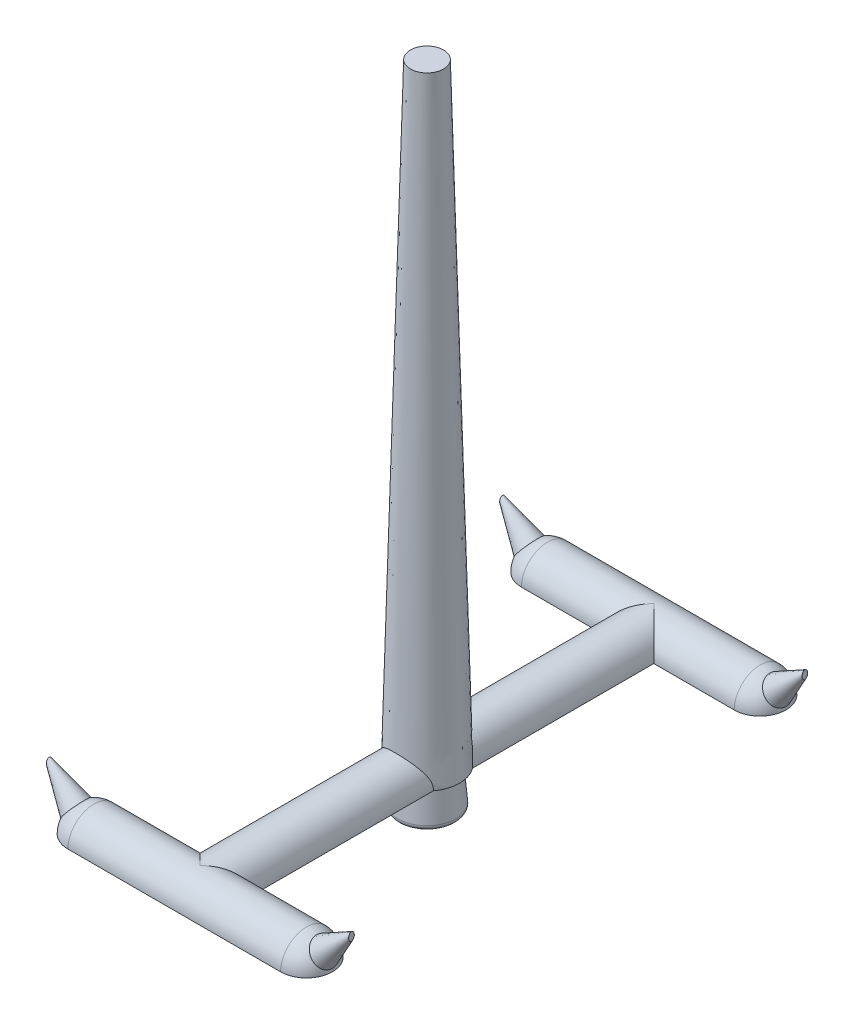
ISO-10303-21;
HEADER;
FILE_DESCRIPTION(('STEP AP214'),'2;1');
FILE_NAME('part.step','',(''),(''),'','','');
FILE_SCHEMA(('AUTOMOTIVE_DESIGN { 1 0 10303 214 1 1 1 1 }'));
ENDSEC;
DATA;
#1=APPLICATION_CONTEXT('core data for automotive mechanical design processes');
#2=APPLICATION_PROTOCOL_DEFINITION('international standard','automotive_design',2000,#1);
#3=PRODUCT_CONTEXT('',#1,'mechanical');
#4=PRODUCT('Part','Part','',(#3));
#5=PRODUCT_RELATED_PRODUCT_CATEGORY('part','',(#4));
#6=PRODUCT_DEFINITION_FORMATION('','',#4);
#7=PRODUCT_DEFINITION_CONTEXT('part definition',#1,'design');
#8=PRODUCT_DEFINITION('design','',#6,#7);
#9=PRODUCT_DEFINITION_SHAPE('','',#8);
#10=(LENGTH_UNIT() NAMED_UNIT(*) SI_UNIT(.MILLI.,.METRE.));
#11=(NAMED_UNIT(*) PLANE_ANGLE_UNIT() SI_UNIT($,.RADIAN.));
#12=(NAMED_UNIT(*) SI_UNIT($,.STERADIAN.) SOLID_ANGLE_UNIT());
#13=UNCERTAINTY_MEASURE_WITH_UNIT(LENGTH_MEASURE(1.E-05),#10,'distance_accuracy_value','');
#14=(GEOMETRIC_REPRESENTATION_CONTEXT(3) GLOBAL_UNCERTAINTY_ASSIGNED_CONTEXT((#13)) GLOBAL_UNIT_ASSIGNED_CONTEXT((#10,
#11,#12)) REPRESENTATION_CONTEXT('',''));
#15=CARTESIAN_POINT('',(0.,0.,0.));
#16=DIRECTION('',(0.,0.,1.));
#17=DIRECTION('',(1.,0.,0.));
#18=AXIS2_PLACEMENT_3D('',#15,#16,#17);
#19=CARTESIAN_POINT('',(11.2600000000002,0.,-24.01));
#20=DIRECTION('',(-1.,0.,0.));
#21=DIRECTION('',(0.,0.,1.));
#22=AXIS2_PLACEMENT_3D('',#19,#20,#21);
#23=DEGENERATE_TOROIDAL_SURFACE('',#22,0.00999999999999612,2.74,.T.);
#24=CARTESIAN_POINT('',(11.2600000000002,0.,-24.));
#25=DIRECTION('',(0.,1.,0.));
#26=DIRECTION('',(0.,0.,1.));
#27=AXIS2_PLACEMENT_3D('',#24,#25,#26);
#28=CIRCLE('',#27,2.74);
#29=CARTESIAN_POINT('',(11.2600000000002,0.,-21.26));
#30=VERTEX_POINT('',#29);
#31=CARTESIAN_POINT('',(14.0000000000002,0.,-24.));
#32=VERTEX_POINT('',#31);
#33=EDGE_CURVE('E518',#30,#32,#28,.T.);
#34=ORIENTED_EDGE('',*,*,#33,.T.);
#35=CARTESIAN_POINT('',(14.0000000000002,0.,-24.01));
#36=DIRECTION('',(-1.,0.,0.));
#37=DIRECTION('',(0.,0.,1.));
#38=AXIS2_PLACEMENT_3D('',#35,#36,#37);
#39=CIRCLE('',#38,0.00999999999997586);
#40=CARTESIAN_POINT('',(14.0000000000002,0.,-24.02));
#41=VERTEX_POINT('',#40);
#42=EDGE_CURVE('E521',#32,#41,#39,.T.);
#43=ORIENTED_EDGE('',*,*,#42,.T.);
#44=CARTESIAN_POINT('',(11.2600000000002,0.,-24.02));
#45=DIRECTION('',(0.,-1.,0.));
#46=DIRECTION('',(0.,0.,-1.));
#47=AXIS2_PLACEMENT_3D('',#44,#45,#46);
#48=CIRCLE('',#47,2.74);
#49=CARTESIAN_POINT('',(11.2600000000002,0.,-26.76));
#50=VERTEX_POINT('',#49);
#51=EDGE_CURVE('E503',#50,#41,#48,.T.);
#52=ORIENTED_EDGE('',*,*,#51,.F.);
#53=CARTESIAN_POINT('',(11.2600000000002,0.,-24.01));
#54=DIRECTION('',(-1.,0.,0.));
#55=DIRECTION('',(0.,0.,1.));
#56=AXIS2_PLACEMENT_3D('',#53,#54,#55);
#57=CIRCLE('',#56,2.75);
#58=EDGE_CURVE('E524',#30,#50,#57,.T.);
#59=ORIENTED_EDGE('',*,*,#58,.F.);
#60=EDGE_LOOP('',(#34,#43,#52,#59));
#61=FACE_BOUND('',#60,.T.);
#62=CARTESIAN_POINT('',(13.6302272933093,0.799483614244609,-25.140504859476));
#63=CARTESIAN_POINT('',(13.6688012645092,0.746594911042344,-25.0964401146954));
#64=CARTESIAN_POINT('',(13.7050890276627,0.696562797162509,-25.046845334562));
#65=CARTESIAN_POINT('',(13.7720385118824,0.603737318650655,-24.9379318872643));
#66=CARTESIAN_POINT('',(13.8026938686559,0.560952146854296,-24.8786023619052));
#67=CARTESIAN_POINT('',(13.8574297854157,0.484037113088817,-24.7519631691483));
#68=CARTESIAN_POINT('',(13.8815192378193,0.449895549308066,-24.6846644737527));
#69=CARTESIAN_POINT('',(13.9224695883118,0.391316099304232,-24.5439407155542));
#70=CARTESIAN_POINT('',(13.9393323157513,0.366875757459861,-24.4705172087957));
#71=CARTESIAN_POINT('',(13.9651537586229,0.328808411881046,-24.3207689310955));
#72=CARTESIAN_POINT('',(13.9742250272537,0.315027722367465,-24.2445026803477));
#73=CARTESIAN_POINT('',(13.9847296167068,0.298377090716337,-24.0902752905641));
#74=CARTESIAN_POINT('',(13.9861644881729,0.29550493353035,-24.0123144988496));
#75=CARTESIAN_POINT('',(13.9814684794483,0.300843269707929,-23.8584991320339));
#76=CARTESIAN_POINT('',(13.9754809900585,0.308843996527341,-23.7826327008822));
#77=CARTESIAN_POINT('',(13.956195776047,0.335022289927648,-23.6336318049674));
#78=CARTESIAN_POINT('',(13.9428971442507,0.353201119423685,-23.5604976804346));
#79=CARTESIAN_POINT('',(13.9092810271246,0.399185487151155,-23.4187527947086));
#80=CARTESIAN_POINT('',(13.8889408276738,0.427022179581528,-23.3501575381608));
#81=CARTESIAN_POINT('',(13.8418119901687,0.491430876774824,-23.2196138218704));
#82=CARTESIAN_POINT('',(13.8150234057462,0.528002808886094,-23.1576653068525));
#83=CARTESIAN_POINT('',(13.7552695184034,0.609416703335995,-23.0411517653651));
#84=CARTESIAN_POINT('',(13.7222152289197,0.65437764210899,-22.986715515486));
#85=CARTESIAN_POINT('',(13.6511224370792,0.750853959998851,-22.8878181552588));
#86=CARTESIAN_POINT('',(13.6130833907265,0.802370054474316,-22.8433581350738));
#87=CARTESIAN_POINT('',(13.5324716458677,0.911273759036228,-22.7650022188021));
#88=CARTESIAN_POINT('',(13.4898410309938,0.968735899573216,-22.7312694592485));
#89=CARTESIAN_POINT('',(13.4016927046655,1.08725415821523,-22.6761494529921));
#90=CARTESIAN_POINT('',(13.3561748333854,1.14831047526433,-22.6547628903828));
#91=CARTESIAN_POINT('',(13.2630156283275,1.27297035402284,-22.6247420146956));
#92=CARTESIAN_POINT('',(13.2153569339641,1.33659401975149,-22.6162448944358));
#93=CARTESIAN_POINT('',(13.1197205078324,1.46398030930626,-22.6126758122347));
#94=CARTESIAN_POINT('',(13.0717427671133,1.5277429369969,-22.6176042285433));
#95=CARTESIAN_POINT('',(12.9767165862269,1.6537833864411,-22.6408055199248));
#96=CARTESIAN_POINT('',(12.9296709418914,1.71605683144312,-22.6591136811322));
#97=CARTESIAN_POINT('',(12.8380209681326,1.83717423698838,-22.7086412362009));
#98=CARTESIAN_POINT('',(12.793416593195,1.89601826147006,-22.7398603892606));
#99=CARTESIAN_POINT('',(12.7082119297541,2.00829010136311,-22.8141748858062));
#100=CARTESIAN_POINT('',(12.66759178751,2.06174481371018,-22.8572068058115));
#101=CARTESIAN_POINT('',(12.5913270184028,2.16204362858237,-22.9540395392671));
#102=CARTESIAN_POINT('',(12.5556821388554,2.20888806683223,-23.0078398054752));
#103=CARTESIAN_POINT('',(12.4908098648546,2.29415444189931,-23.1241028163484));
#104=CARTESIAN_POINT('',(12.4615210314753,2.33265700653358,-23.1864721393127));
#105=CARTESIAN_POINT('',(12.4098232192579,2.40070640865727,-23.3185205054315));
#106=CARTESIAN_POINT('',(12.3874138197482,2.43025379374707,-23.3881991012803));
#107=CARTESIAN_POINT('',(12.3503908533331,2.47924711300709,-23.5320779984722));
#108=CARTESIAN_POINT('',(12.3356957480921,2.49879864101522,-23.6062213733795));
#109=CARTESIAN_POINT('',(12.3142047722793,2.52770012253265,-23.7575774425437));
#110=CARTESIAN_POINT('',(12.3074085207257,2.53705056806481,-23.8347899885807));
#111=CARTESIAN_POINT('',(12.3019567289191,2.54524008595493,-23.9894620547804));
#112=CARTESIAN_POINT('',(12.3032394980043,2.54415878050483,-24.0669152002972));
#113=CARTESIAN_POINT('',(12.3137659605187,2.53170622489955,-24.2204396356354));
#114=CARTESIAN_POINT('',(12.3230094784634,2.5203352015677,-24.2965109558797));
#115=CARTESIAN_POINT('',(12.3491457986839,2.48766862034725,-24.4449553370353));
#116=CARTESIAN_POINT('',(12.3660228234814,2.46639353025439,-24.517335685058));
#117=CARTESIAN_POINT('',(12.4069039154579,2.41454079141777,-24.656536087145));
#118=CARTESIAN_POINT('',(12.4309080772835,2.38396301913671,-24.723356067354));
#119=CARTESIAN_POINT('',(12.4854263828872,2.31423607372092,-24.8498463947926));
#120=CARTESIAN_POINT('',(12.5159666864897,2.27505244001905,-24.909486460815));
#121=CARTESIAN_POINT('',(12.582579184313,2.18929908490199,-25.0196715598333));
#122=CARTESIAN_POINT('',(12.6186516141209,2.14272904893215,-25.0702162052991));
#123=CARTESIAN_POINT('',(12.6956083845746,2.04305656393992,-25.161270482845));
#124=CARTESIAN_POINT('',(12.736532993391,1.98989925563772,-25.2016860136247));
#125=CARTESIAN_POINT('',(12.8217269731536,1.87887426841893,-25.2708215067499));
#126=CARTESIAN_POINT('',(12.8659964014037,1.8210065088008,-25.2995412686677));
#127=CARTESIAN_POINT('',(12.9571041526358,1.70150111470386,-25.3448010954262));
#128=CARTESIAN_POINT('',(13.0039651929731,1.63982930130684,-25.3612051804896));
#129=CARTESIAN_POINT('',(13.0984757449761,1.51498721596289,-25.3809124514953));
#130=CARTESIAN_POINT('',(13.1461254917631,1.45181649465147,-25.3842116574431));
#131=CARTESIAN_POINT('',(13.2413096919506,1.32513074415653,-25.3776138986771));
#132=CARTESIAN_POINT('',(13.2888386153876,1.26161825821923,-25.3675895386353));
#133=CARTESIAN_POINT('',(13.3819286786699,1.13669470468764,-25.3344139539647));
#134=CARTESIAN_POINT('',(13.427492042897,1.07528127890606,-25.3112780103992));
#135=CARTESIAN_POINT('',(13.4994025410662,0.977917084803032,-25.263243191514));
#136=CARTESIAN_POINT('',(13.5267196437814,0.940818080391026,-25.2420351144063));
#137=CARTESIAN_POINT('',(13.5797478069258,0.868581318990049,-25.1948130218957));
#138=CARTESIAN_POINT('',(13.6054588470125,0.833443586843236,-25.1687989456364));
#139=CARTESIAN_POINT('',(13.6302272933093,0.799483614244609,-25.140504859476));
#140=B_SPLINE_CURVE_WITH_KNOTS('',3,(#62,#63,#64,#65,#66,#67,#68,#69,#70,#71,#72,#73,#74,#75,
#76,#77,#78,#79,#80,#81,#82,#83,#84,#85,#86,#87,#88,#89,#90,#91,#92,#93,#94,#95,#96,#97,#98,#99,
#100,#101,#102,#103,#104,#105,#106,#107,#108,#109,#110,#111,#112,#113,#114,#115,#116,#117,#118,
#119,#120,#121,#122,#123,#124,#125,#126,#127,#128,#129,#130,#131,#132,#133,#134,#135,#136,#137,
#138,#139),.UNSPECIFIED.,.T.,.F.,(4,2,2,2,2,2,2,2,2,2,2,2,2,2,2,2,2,2,2,2,2,2,2,2,2,2,2,2,2,2,2,
2,2,2,2,2,2,2,4),(0.,0.236547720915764,0.473361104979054,0.709852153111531,0.946283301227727,
1.17923865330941,1.41214669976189,1.64062454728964,1.86913075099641,2.09838102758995,
2.32762939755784,2.56041754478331,2.79323111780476,3.02943244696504,3.26564686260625,
3.5043582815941,3.74307642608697,3.98242641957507,4.22177194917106,4.4598567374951,
4.69792942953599,4.93358678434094,5.16922972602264,5.40232910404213,5.63541723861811,
5.86672770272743,6.09803306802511,6.32886252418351,6.55969504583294,6.79146931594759,
7.02325345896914,7.25711713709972,7.49098482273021,7.7273981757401,7.96388332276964,
8.20264600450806,8.44113098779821,8.59301696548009,8.74490486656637),.UNSPECIFIED.);
#141=CARTESIAN_POINT('',(13.6302272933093,0.799483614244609,-25.140504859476));
#142=VERTEX_POINT('',#141);
#143=EDGE_CURVE('E596',#142,#142,#140,.T.);
#144=ORIENTED_EDGE('',*,*,#143,.T.);
#145=EDGE_LOOP('',(#144));
#146=FACE_BOUND('',#145,.T.);
#147=ADVANCED_FACE('F367',(#61,#146),#23,.T.);
#148=CARTESIAN_POINT('',(12.9216999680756,1.273673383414,24.));
#149=DIRECTION('',(-0.707106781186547,-0.707106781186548,0.));
#150=DIRECTION('',(-0.707106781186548,0.707106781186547,0.));
#151=AXIS2_PLACEMENT_3D('',#148,#149,#150);
#152=CONICAL_SURFACE('',#151,1.45867018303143,0.26179938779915);
#153=CARTESIAN_POINT('',(13.6199162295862,0.793081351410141,22.8535560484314));
#154=CARTESIAN_POINT('',(13.6587603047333,0.740508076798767,22.8973429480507));
#155=CARTESIAN_POINT('',(13.6953882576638,0.690812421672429,22.9466502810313));
#156=CARTESIAN_POINT('',(13.7631504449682,0.598697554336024,23.0549828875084));
#157=CARTESIAN_POINT('',(13.7942785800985,0.556286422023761,23.1140188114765));
#158=CARTESIAN_POINT('',(13.8500805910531,0.480144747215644,23.2400780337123));
#159=CARTESIAN_POINT('',(13.874762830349,0.446402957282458,23.3070908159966));
#160=CARTESIAN_POINT('',(13.916999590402,0.388633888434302,23.4472526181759));
#161=CARTESIAN_POINT('',(13.9345558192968,0.364604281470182,23.5204001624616));
#162=CARTESIAN_POINT('',(13.96183563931,0.327335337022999,23.6696244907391));
#163=CARTESIAN_POINT('',(13.9716695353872,0.31394400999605,23.7456431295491));
#164=CARTESIAN_POINT('',(13.9837365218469,0.297998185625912,23.8993968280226));
#165=CARTESIAN_POINT('',(13.9859711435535,0.295441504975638,23.9771315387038));
#166=CARTESIAN_POINT('',(13.9829038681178,0.301363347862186,24.1307155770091));
#167=CARTESIAN_POINT('',(13.9777276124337,0.309657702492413,24.2065746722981));
#168=CARTESIAN_POINT('',(13.9600567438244,0.336400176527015,24.3556047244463));
#169=CARTESIAN_POINT('',(13.9475611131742,0.35484970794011,24.4287753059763));
#170=CARTESIAN_POINT('',(13.9154917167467,0.401346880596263,24.5707405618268));
#171=CARTESIAN_POINT('',(13.8958862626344,0.429437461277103,24.6395139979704));
#172=CARTESIAN_POINT('',(13.8501452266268,0.494308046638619,24.7704668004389));
#173=CARTESIAN_POINT('',(13.8240096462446,0.531088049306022,24.8326461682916));
#174=CARTESIAN_POINT('',(13.7654082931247,0.612955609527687,24.9497997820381));
#175=CARTESIAN_POINT('',(13.7328397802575,0.658177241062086,25.0046289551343));
#176=CARTESIAN_POINT('',(13.6625751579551,0.755152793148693,25.1043213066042));
#177=CARTESIAN_POINT('',(13.6248784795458,0.806907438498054,25.1491833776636));
#178=CARTESIAN_POINT('',(13.5448088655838,0.916262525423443,25.228336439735));
#179=CARTESIAN_POINT('',(13.5023762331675,0.973936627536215,25.2624653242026));
#180=CARTESIAN_POINT('',(13.4144693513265,1.09285186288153,25.3183482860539));
#181=CARTESIAN_POINT('',(13.368994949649,1.15409317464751,25.3401017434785));
#182=CARTESIAN_POINT('',(13.2758379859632,1.27900886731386,25.3707865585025));
#183=CARTESIAN_POINT('',(13.228138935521,1.34270047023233,25.3795978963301));
#184=CARTESIAN_POINT('',(13.1322859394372,1.47018332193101,25.3837555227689));
#185=CARTESIAN_POINT('',(13.0841319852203,1.53397457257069,25.3791015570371));
#186=CARTESIAN_POINT('',(12.9887153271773,1.65991830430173,25.3564120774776));
#187=CARTESIAN_POINT('',(12.9414534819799,1.72206922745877,25.3383642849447));
#188=CARTESIAN_POINT('',(12.849260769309,1.84290281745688,25.2893318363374));
#189=CARTESIAN_POINT('',(12.8043298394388,1.90158557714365,25.2583475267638));
#190=CARTESIAN_POINT('',(12.7184376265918,2.01342153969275,25.1845165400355));
#191=CARTESIAN_POINT('',(12.6774521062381,2.06660867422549,25.1417494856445));
#192=CARTESIAN_POINT('',(12.6003663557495,2.16635277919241,25.0454362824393));
#193=CARTESIAN_POINT('',(12.5642658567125,2.21291011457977,24.9918907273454));
#194=CARTESIAN_POINT('',(12.4984270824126,2.29757059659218,24.8761495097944));
#195=CARTESIAN_POINT('',(12.468625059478,2.33575861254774,24.8140521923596));
#196=CARTESIAN_POINT('',(12.4158289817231,2.40318552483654,24.682535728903));
#197=CARTESIAN_POINT('',(12.3928345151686,2.43242496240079,24.6131170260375));
#198=CARTESIAN_POINT('',(12.3545797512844,2.48083234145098,24.4697117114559));
#199=CARTESIAN_POINT('',(12.3392410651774,2.50010243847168,24.3957804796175));
#200=CARTESIAN_POINT('',(12.3164172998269,2.52846479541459,24.2448189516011));
#201=CARTESIAN_POINT('',(12.3089318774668,2.53755749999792,24.1677887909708));
#202=CARTESIAN_POINT('',(12.3020688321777,2.54527251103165,24.0133655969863));
#203=CARTESIAN_POINT('',(12.3026375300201,2.54396416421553,23.9359783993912));
#204=CARTESIAN_POINT('',(12.3117284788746,2.5310825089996,23.782538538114));
#205=CARTESIAN_POINT('',(12.3202506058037,2.51950936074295,23.7064858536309));
#206=CARTESIAN_POINT('',(12.3449668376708,2.48645129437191,23.5579305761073));
#207=CARTESIAN_POINT('',(12.3611546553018,2.46497449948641,23.4854251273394));
#208=CARTESIAN_POINT('',(12.4006955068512,2.41273373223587,23.3459250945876));
#209=CARTESIAN_POINT('',(12.424048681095,2.38196957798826,23.2789306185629));
#210=CARTESIAN_POINT('',(12.4773454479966,2.31184961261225,23.151967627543));
#211=CARTESIAN_POINT('',(12.507322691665,2.2724499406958,23.0920374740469));
#212=CARTESIAN_POINT('',(12.5728905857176,2.1862709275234,22.9812413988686));
#213=CARTESIAN_POINT('',(12.6084814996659,2.13949123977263,22.9303759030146));
#214=CARTESIAN_POINT('',(12.684591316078,2.03937530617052,22.8386232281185));
#215=CARTESIAN_POINT('',(12.7251543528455,1.98598028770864,22.7978368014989));
#216=CARTESIAN_POINT('',(12.8097391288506,1.87448858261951,22.7279615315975));
#217=CARTESIAN_POINT('',(12.8537609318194,1.81639180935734,22.6988729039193));
#218=CARTESIAN_POINT('',(12.9444906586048,1.69644650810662,22.652890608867));
#219=CARTESIAN_POINT('',(12.9912224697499,1.63456422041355,22.6361321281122));
#220=CARTESIAN_POINT('',(13.0856055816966,1.50932716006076,22.6157501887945));
#221=CARTESIAN_POINT('',(13.1332571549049,1.44597194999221,22.6121306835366));
#222=CARTESIAN_POINT('',(13.2285343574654,1.3190122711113,22.6181357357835));
#223=CARTESIAN_POINT('',(13.2761561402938,1.25541044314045,22.6278760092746));
#224=CARTESIAN_POINT('',(13.3695659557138,1.13035970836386,22.6605330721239));
#225=CARTESIAN_POINT('',(13.4153560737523,1.06890836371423,22.6834343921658));
#226=CARTESIAN_POINT('',(13.487766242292,0.971501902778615,22.7311553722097));
#227=CARTESIAN_POINT('',(13.5153178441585,0.934380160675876,22.7522696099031));
#228=CARTESIAN_POINT('',(13.5688593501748,0.862133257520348,22.7993415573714));
#229=CARTESIAN_POINT('',(13.5948492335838,0.827008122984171,22.8252993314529));
#230=CARTESIAN_POINT('',(13.6199162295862,0.793081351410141,22.8535560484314));
#231=B_SPLINE_CURVE_WITH_KNOTS('',3,(#153,#154,#155,#156,#157,#158,#159,#160,#161,#162,#163,
#164,#165,#166,#167,#168,#169,#170,#171,#172,#173,#174,#175,#176,#177,#178,#179,#180,#181,#182,
#183,#184,#185,#186,#187,#188,#189,#190,#191,#192,#193,#194,#195,#196,#197,#198,#199,#200,#201,
#202,#203,#204,#205,#206,#207,#208,#209,#210,#211,#212,#213,#214,#215,#216,#217,#218,#219,#220,
#221,#222,#223,#224,#225,#226,#227,#228,#229,#230),.UNSPECIFIED.,.T.,.F.,(4,2,2,2,2,2,2,2,2,2,2,
2,2,2,2,2,2,2,2,2,2,2,2,2,2,2,2,2,2,2,2,2,2,2,2,2,2,2,4),(0.,0.235847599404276,
0.471955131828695,0.707754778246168,0.94349786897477,1.17580906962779,1.40807345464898,
1.63644642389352,1.86485115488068,2.09428665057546,2.32372209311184,2.557171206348,
2.79064624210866,3.02749473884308,3.26435509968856,3.50339843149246,3.74244627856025,
3.98171354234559,4.22097439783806,4.45865649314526,4.69632549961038,4.93145973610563,
5.16657974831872,5.39924023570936,5.63189055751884,5.86299104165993,6.09408792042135,
6.32499558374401,6.55590776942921,6.78802114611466,7.02014542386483,7.25450387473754,
7.48886664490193,7.72576214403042,7.96272891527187,8.20176119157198,8.44051308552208,
8.59270907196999,8.74490707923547),.UNSPECIFIED.);
#232=CARTESIAN_POINT('',(13.6199162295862,0.793081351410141,22.8535560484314));
#233=VERTEX_POINT('',#232);
#234=EDGE_CURVE('E623',#233,#233,#231,.T.);
#235=ORIENTED_EDGE('',*,*,#234,.F.);
#236=EDGE_LOOP('',(#235));
#237=FACE_BOUND('',#236,.T.);
#238=CARTESIAN_POINT('',(16.0022866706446,3.89154544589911,23.8087370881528));
#239=CARTESIAN_POINT('',(16.0026686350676,3.91142299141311,23.7927593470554));
#240=CARTESIAN_POINT('',(16.0030499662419,3.93294223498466,23.7787775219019));
#241=CARTESIAN_POINT('',(16.0037613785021,3.97798354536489,23.7544070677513));
#242=CARTESIAN_POINT('',(16.0040911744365,4.0015157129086,23.7440380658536));
#243=CARTESIAN_POINT('',(16.0047689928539,4.05819297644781,23.7235548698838));
#244=CARTESIAN_POINT('',(16.0050832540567,4.09182825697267,23.7147908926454));
#245=CARTESIAN_POINT('',(16.0055206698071,4.16003923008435,23.7027890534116));
#246=CARTESIAN_POINT('',(16.0056437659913,4.19461520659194,23.6995528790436));
#247=CARTESIAN_POINT('',(16.0056836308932,4.26442462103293,23.6984933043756));
#248=CARTESIAN_POINT('',(16.0055969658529,4.29965950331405,23.7007599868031));
#249=CARTESIAN_POINT('',(16.0052138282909,4.36924869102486,23.7111681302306));
#250=CARTESIAN_POINT('',(16.0049177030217,4.40360435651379,23.7192998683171));
#251=CARTESIAN_POINT('',(16.0042824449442,4.45873416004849,23.7381709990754));
#252=CARTESIAN_POINT('',(16.0039924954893,4.48014130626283,23.7470728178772));
#253=CARTESIAN_POINT('',(16.0033586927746,4.5213992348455,23.7679694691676));
#254=CARTESIAN_POINT('',(16.0030149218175,4.54125232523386,23.7799595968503));
#255=CARTESIAN_POINT('',(16.0023997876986,4.57373846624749,23.8038022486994));
#256=CARTESIAN_POINT('',(16.0021323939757,4.58691942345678,23.8149055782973));
#257=CARTESIAN_POINT('',(16.0016102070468,4.61138396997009,23.8390464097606));
#258=CARTESIAN_POINT('',(16.0013553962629,4.62267026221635,23.8520811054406));
#259=CARTESIAN_POINT('',(16.0009378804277,4.64050837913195,23.8770153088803));
#260=CARTESIAN_POINT('',(16.0007671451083,4.64755644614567,23.8885579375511));
#261=CARTESIAN_POINT('',(16.0004678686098,4.65966980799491,23.9126484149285));
#262=CARTESIAN_POINT('',(16.0003392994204,4.66473641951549,23.9251955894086));
#263=CARTESIAN_POINT('',(16.0001388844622,4.67255358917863,23.9511045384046));
#264=CARTESIAN_POINT('',(16.0000674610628,4.67528691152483,23.9644716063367));
#265=CARTESIAN_POINT('',(15.9999931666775,4.67812919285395,23.991482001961));
#266=CARTESIAN_POINT('',(15.9999902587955,4.67823956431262,24.0051251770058));
#267=CARTESIAN_POINT('',(16.0000495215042,4.67597362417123,24.0305862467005));
#268=CARTESIAN_POINT('',(16.0001041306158,4.6738862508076,24.0424312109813));
#269=CARTESIAN_POINT('',(16.0002607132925,4.66781205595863,24.0656191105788));
#270=CARTESIAN_POINT('',(16.0003626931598,4.66382498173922,24.0769619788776));
#271=CARTESIAN_POINT('',(16.0006078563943,4.65403426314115,24.0992673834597));
#272=CARTESIAN_POINT('',(16.0007522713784,4.64817578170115,24.1102055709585));
#273=CARTESIAN_POINT('',(16.0010682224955,4.63498989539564,24.1311499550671));
#274=CARTESIAN_POINT('',(16.001239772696,4.62766172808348,24.1411556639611));
#275=CARTESIAN_POINT('',(16.0016953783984,4.60750786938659,24.1653461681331));
#276=CARTESIAN_POINT('',(16.0019899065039,4.59385893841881,24.1788467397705));
#277=CARTESIAN_POINT('',(16.0025791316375,4.56457967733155,24.2034991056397));
#278=CARTESIAN_POINT('',(16.0028738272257,4.54894444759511,24.2146449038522));
#279=CARTESIAN_POINT('',(16.0035552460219,4.50950417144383,24.2389051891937));
#280=CARTESIAN_POINT('',(16.0039290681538,4.48501212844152,24.2509009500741));
#281=CARTESIAN_POINT('',(16.0045811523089,4.43446567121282,24.2708793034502));
#282=CARTESIAN_POINT('',(16.0048592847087,4.40840919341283,24.2788564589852));
#283=CARTESIAN_POINT('',(16.0053655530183,4.34723343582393,24.2930658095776));
#284=CARTESIAN_POINT('',(16.0055514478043,4.31180915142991,24.2979900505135));
#285=CARTESIAN_POINT('',(16.0057029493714,4.24059703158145,24.3020216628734));
#286=CARTESIAN_POINT('',(16.0056681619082,4.20480865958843,24.3011186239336));
#287=CARTESIAN_POINT('',(16.0053849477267,4.13348936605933,24.2935050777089));
#288=CARTESIAN_POINT('',(16.0051343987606,4.0979645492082,24.2867368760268));
#289=CARTESIAN_POINT('',(16.0044489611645,4.02871962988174,24.266955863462));
#290=CARTESIAN_POINT('',(16.0040146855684,3.99499394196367,24.2539638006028));
#291=CARTESIAN_POINT('',(16.0032586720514,3.94578863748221,24.2284850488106));
#292=CARTESIAN_POINT('',(16.0029762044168,3.92901423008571,24.2184808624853));
#293=CARTESIAN_POINT('',(16.0023982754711,3.89704126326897,24.1961930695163));
#294=CARTESIAN_POINT('',(16.0021028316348,3.88184067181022,24.18391246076));
#295=CARTESIAN_POINT('',(16.0015914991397,3.8568775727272,24.1599104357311));
#296=CARTESIAN_POINT('',(16.0013724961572,3.84665660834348,24.1486688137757));
#297=CARTESIAN_POINT('',(16.0009629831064,3.82812523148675,24.1246988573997));
#298=CARTESIAN_POINT('',(16.0007724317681,3.81981204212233,24.1119727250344));
#299=CARTESIAN_POINT('',(16.0004763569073,3.80715621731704,24.0879456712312));
#300=CARTESIAN_POINT('',(16.0003614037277,3.80234841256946,24.0768912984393));
#301=CARTESIAN_POINT('',(16.0001751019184,3.79463212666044,24.0541350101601));
#302=CARTESIAN_POINT('',(16.0001037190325,3.7917221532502,24.0424336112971));
#303=CARTESIAN_POINT('',(16.000012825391,3.78802628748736,24.0186352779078));
#304=CARTESIAN_POINT('',(15.9999935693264,3.78725082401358,24.0065366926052));
#305=CARTESIAN_POINT('',(16.0000102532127,3.78792589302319,23.9824034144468));
#306=CARTESIAN_POINT('',(16.0000461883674,3.78937623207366,23.9703687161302));
#307=CARTESIAN_POINT('',(16.0001640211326,3.79418798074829,23.9476109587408));
#308=CARTESIAN_POINT('',(16.0002423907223,3.797402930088,23.9368561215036));
#309=CARTESIAN_POINT('',(16.0004346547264,3.80541675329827,23.9159535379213));
#310=CARTESIAN_POINT('',(16.0005485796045,3.81021698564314,23.9058063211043));
#311=CARTESIAN_POINT('',(16.0008553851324,3.82341803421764,23.8821997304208));
#312=CARTESIAN_POINT('',(16.0010614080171,3.83248628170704,23.869114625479));
#313=CARTESIAN_POINT('',(16.0015002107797,3.8525926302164,23.8445896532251));
#314=CARTESIAN_POINT('',(16.0017329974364,3.86363123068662,23.8331502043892));
#315=CARTESIAN_POINT('',(16.0020744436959,3.880630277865,23.8177665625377));
#316=CARTESIAN_POINT('',(16.0021805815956,3.88602453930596,23.8131748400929));
#317=CARTESIAN_POINT('',(16.0022866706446,3.89154544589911,23.8087370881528));
#318=B_SPLINE_CURVE_WITH_KNOTS('',3,(#238,#239,#240,#241,#242,#243,#244,#245,#246,#247,#248,
#249,#250,#251,#252,#253,#254,#255,#256,#257,#258,#259,#260,#261,#262,#263,#264,#265,#266,#267,
#268,#269,#270,#271,#272,#273,#274,#275,#276,#277,#278,#279,#280,#281,#282,#283,#284,#285,#286,
#287,#288,#289,#290,#291,#292,#293,#294,#295,#296,#297,#298,#299,#300,#301,#302,#303,#304,#305,
#306,#307,#308,#309,#310,#311,#312,#313,#314,#315,#316,#317),.UNSPECIFIED.,.T.,.F.,(4,2,2,2,2,2,
2,2,2,2,2,2,2,2,2,2,2,2,2,2,2,2,2,2,2,2,2,2,2,2,2,2,2,2,2,2,2,2,2,4),(0.,0.0765013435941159,
0.15341203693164,0.257147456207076,0.360914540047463,0.466391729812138,0.57169446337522,
0.641052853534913,0.710306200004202,0.761846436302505,0.813312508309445,0.85373163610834,
0.894123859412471,0.934811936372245,0.975478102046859,1.01139446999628,1.04731561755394,
1.084404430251,1.12151253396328,1.17878860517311,1.23620880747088,1.31758528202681,
1.39907156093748,1.50582360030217,1.61276640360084,1.72077327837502,1.8284225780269,
1.88687539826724,1.94525178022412,1.9906841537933,2.03604997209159,2.07206929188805,
2.10806025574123,2.14422675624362,2.18039011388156,2.21392678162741,2.24749226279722,
2.29499536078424,2.3425105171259,2.36375845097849),.UNSPECIFIED.);
#319=CARTESIAN_POINT('',(16.0022866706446,3.89154544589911,23.8087370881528));
#320=VERTEX_POINT('',#319);
#321=EDGE_CURVE('E601',#320,#320,#318,.T.);
#322=ORIENTED_EDGE('',*,*,#321,.F.);
#323=EDGE_LOOP('',(#322));
#324=FACE_BOUND('',#323,.T.);
#325=ADVANCED_FACE('F580',(#237,#324),#152,.T.);
#326=CARTESIAN_POINT('',(11.2600000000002,0.,24.01));
#327=DIRECTION('',(-1.,0.,0.));
#328=DIRECTION('',(0.,0.,-1.));
#329=AXIS2_PLACEMENT_3D('',#326,#327,#328);
#330=DEGENERATE_TOROIDAL_SURFACE('',#329,0.00999999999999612,2.74,.T.);
#331=CARTESIAN_POINT('',(11.2600000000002,0.,24.));
#332=DIRECTION('',(0.,-1.,0.));
#333=DIRECTION('',(0.,0.,-1.));
#334=AXIS2_PLACEMENT_3D('',#331,#332,#333);
#335=CIRCLE('',#334,2.74);
#336=CARTESIAN_POINT('',(11.2600000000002,0.,21.26));
#337=VERTEX_POINT('',#336);
#338=CARTESIAN_POINT('',(14.0000000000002,0.,24.));
#339=VERTEX_POINT('',#338);
#340=EDGE_CURVE('E700',#337,#339,#335,.T.);
#341=ORIENTED_EDGE('',*,*,#340,.F.);
#342=CARTESIAN_POINT('',(11.2600000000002,0.,24.01));
#343=DIRECTION('',(1.,0.,0.));
#344=DIRECTION('',(0.,0.,-1.));
#345=AXIS2_PLACEMENT_3D('',#342,#343,#344);
#346=CIRCLE('',#345,2.75);
#347=CARTESIAN_POINT('',(11.2600000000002,0.,26.76));
#348=VERTEX_POINT('',#347);
#349=EDGE_CURVE('E493',#337,#348,#346,.T.);
#350=ORIENTED_EDGE('',*,*,#349,.T.);
#351=CARTESIAN_POINT('',(11.2600000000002,0.,24.02));
#352=DIRECTION('',(0.,1.,0.));
#353=DIRECTION('',(0.,0.,1.));
#354=AXIS2_PLACEMENT_3D('',#351,#352,#353);
#355=CIRCLE('',#354,2.74);
#356=CARTESIAN_POINT('',(14.0000000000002,0.,24.02));
#357=VERTEX_POINT('',#356);
#358=EDGE_CURVE('E691',#348,#357,#355,.T.);
#359=ORIENTED_EDGE('',*,*,#358,.T.);
#360=CARTESIAN_POINT('',(14.0000000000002,0.,24.01));
#361=DIRECTION('',(1.,0.,0.));
#362=DIRECTION('',(0.,0.,-1.));
#363=AXIS2_PLACEMENT_3D('',#360,#361,#362);
#364=CIRCLE('',#363,0.00999999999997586);
#365=EDGE_CURVE('E702',#339,#357,#364,.T.);
#366=ORIENTED_EDGE('',*,*,#365,.F.);
#367=EDGE_LOOP('',(#341,#350,#359,#366));
#368=FACE_BOUND('',#367,.T.);
#369=ORIENTED_EDGE('',*,*,#234,.T.);
#370=EDGE_LOOP('',(#369));
#371=FACE_BOUND('',#370,.T.);
#372=ADVANCED_FACE('F587',(#368,#371),#330,.T.);
#373=CARTESIAN_POINT('',(-12.9216999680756,1.273673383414,-24.));
#374=DIRECTION('',(0.707106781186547,-0.707106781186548,0.));
#375=DIRECTION('',(0.707106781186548,0.707106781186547,0.));
#376=AXIS2_PLACEMENT_3D('',#373,#374,#375);
#377=CONICAL_SURFACE('',#376,1.45867018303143,0.26179938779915);
#378=CARTESIAN_POINT('',(-13.7332188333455,0.657558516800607,-25.0010054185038));
#379=CARTESIAN_POINT('',(-13.6993808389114,0.70444523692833,-25.0550540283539));
#380=CARTESIAN_POINT('',(-13.6627022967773,0.754985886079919,-25.1042431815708));
#381=CARTESIAN_POINT('',(-13.5847095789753,0.861858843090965,-25.1915106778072));
#382=CARTESIAN_POINT('',(-13.5433892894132,0.918198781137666,-25.2295741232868));
#383=CARTESIAN_POINT('',(-13.4572546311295,1.03506460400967,-25.2935426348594));
#384=CARTESIAN_POINT('',(-13.412437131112,1.0955942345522,-25.3194366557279));
#385=CARTESIAN_POINT('',(-13.3206104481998,1.21906058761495,-25.3583026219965));
#386=CARTESIAN_POINT('',(-13.2736018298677,1.28199668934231,-25.3712778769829));
#387=CARTESIAN_POINT('',(-13.1783792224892,1.40896477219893,-25.3839979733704));
#388=CARTESIAN_POINT('',(-13.1301592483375,1.47300127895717,-25.3836531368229));
#389=CARTESIAN_POINT('',(-13.0342087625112,1.59994843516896,-25.3694886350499));
#390=CARTESIAN_POINT('',(-12.9864782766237,1.66285902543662,-25.3556682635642));
#391=CARTESIAN_POINT('',(-12.892998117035,1.78564847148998,-25.3149341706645));
#392=CARTESIAN_POINT('',(-12.8472448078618,1.84553292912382,-25.2880456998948));
#393=CARTESIAN_POINT('',(-12.7589875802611,1.96068590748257,-25.221894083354));
#394=CARTESIAN_POINT('',(-12.716483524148,2.01595462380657,-25.1826314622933));
#395=CARTESIAN_POINT('',(-12.6363621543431,2.11983019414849,-25.0931853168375));
#396=CARTESIAN_POINT('',(-12.5987065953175,2.16848937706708,-25.0430968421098));
#397=CARTESIAN_POINT('',(-12.5290227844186,2.25827615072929,-24.9331968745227));
#398=CARTESIAN_POINT('',(-12.4969941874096,2.29940420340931,-24.8733859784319));
#399=CARTESIAN_POINT('',(-12.4398859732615,2.3725061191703,-24.7464498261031));
#400=CARTESIAN_POINT('',(-12.4147333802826,2.4045762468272,-24.6794128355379));
#401=CARTESIAN_POINT('',(-12.371697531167,2.4592203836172,-24.5393980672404));
#402=CARTESIAN_POINT('',(-12.3538138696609,2.48179492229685,-24.4664206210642));
#403=CARTESIAN_POINT('',(-12.3260118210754,2.51661216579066,-24.3173444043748));
#404=CARTESIAN_POINT('',(-12.3160193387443,2.52895103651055,-24.2412818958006));
#405=CARTESIAN_POINT('',(-12.3040273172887,2.54329503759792,-24.0875699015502));
#406=CARTESIAN_POINT('',(-12.3020274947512,2.54530053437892,-24.0099204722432));
#407=CARTESIAN_POINT('',(-12.3060680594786,2.53893661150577,-23.8556352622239));
#408=CARTESIAN_POINT('',(-12.3120698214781,2.53061704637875,-23.7789964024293));
#409=CARTESIAN_POINT('',(-12.3318528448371,2.50393246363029,-23.6285246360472));
#410=CARTESIAN_POINT('',(-12.3456340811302,2.48556747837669,-23.5546917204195));
#411=CARTESIAN_POINT('',(-12.3805674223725,2.43929516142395,-23.411812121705));
#412=CARTESIAN_POINT('',(-12.4017291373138,2.41137538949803,-23.3427718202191));
#413=CARTESIAN_POINT('',(-12.4507675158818,2.34680158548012,-23.211498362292));
#414=CARTESIAN_POINT('',(-12.4786443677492,2.31014730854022,-23.1492653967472));
#415=CARTESIAN_POINT('',(-12.5404867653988,2.22885847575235,-23.0328965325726));
#416=CARTESIAN_POINT('',(-12.5744933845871,2.18417009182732,-22.9788200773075));
#417=CARTESIAN_POINT('',(-12.6474450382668,2.08824767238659,-22.8807450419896));
#418=CARTESIAN_POINT('',(-12.6863903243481,2.03701330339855,-22.8367469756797));
#419=CARTESIAN_POINT('',(-12.7685100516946,1.92885392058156,-22.7595841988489));
#420=CARTESIAN_POINT('',(-12.8117244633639,1.87187499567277,-22.7265376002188));
#421=CARTESIAN_POINT('',(-12.9007772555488,1.75426698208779,-22.6727777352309));
#422=CARTESIAN_POINT('',(-12.9466157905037,1.69363767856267,-22.6520651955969));
#423=CARTESIAN_POINT('',(-13.0401001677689,1.56974849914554,-22.6233482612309));
#424=CARTESIAN_POINT('',(-13.0877599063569,1.50646772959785,-22.6154791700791));
#425=CARTESIAN_POINT('',(-13.1830687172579,1.37964275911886,-22.6130589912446));
#426=CARTESIAN_POINT('',(-13.2307177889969,1.31609854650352,-22.618508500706));
#427=CARTESIAN_POINT('',(-13.3249664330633,1.19011642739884,-22.6426458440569));
#428=CARTESIAN_POINT('',(-13.3715573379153,1.12768820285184,-22.6614181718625));
#429=CARTESIAN_POINT('',(-13.4620528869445,1.00614110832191,-22.7117852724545));
#430=CARTESIAN_POINT('',(-13.50595748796,0.947022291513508,-22.743380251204));
#431=CARTESIAN_POINT('',(-13.5897905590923,0.833876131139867,-22.8185008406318));
#432=CARTESIAN_POINT('',(-13.6297232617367,0.779843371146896,-22.8620135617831));
#433=CARTESIAN_POINT('',(-13.7045236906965,0.678415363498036,-22.9597999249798));
#434=CARTESIAN_POINT('',(-13.7393917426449,0.631019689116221,-23.0140728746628));
#435=CARTESIAN_POINT('',(-13.8027503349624,0.544743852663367,-23.1313117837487));
#436=CARTESIAN_POINT('',(-13.8312981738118,0.505787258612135,-23.1941905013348));
#437=CARTESIAN_POINT('',(-13.8816041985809,0.437057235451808,-23.3272674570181));
#438=CARTESIAN_POINT('',(-13.9033623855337,0.407283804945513,-23.3974656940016));
#439=CARTESIAN_POINT('',(-13.9391896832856,0.358271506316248,-23.5421027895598));
#440=CARTESIAN_POINT('',(-13.9533649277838,0.33888722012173,-23.6164660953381));
#441=CARTESIAN_POINT('',(-13.9741046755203,0.31069173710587,-23.7681874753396));
#442=CARTESIAN_POINT('',(-13.9806713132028,0.301877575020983,-23.8455447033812));
#443=CARTESIAN_POINT('',(-13.986124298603,0.295447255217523,-23.9997717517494));
#444=CARTESIAN_POINT('',(-13.9851296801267,0.297657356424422,-24.0766301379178));
#445=CARTESIAN_POINT('',(-13.9757249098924,0.312713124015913,-24.2288564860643));
#446=CARTESIAN_POINT('',(-13.9673123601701,0.325562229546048,-24.3042239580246));
#447=CARTESIAN_POINT('',(-13.9432599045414,0.361138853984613,-24.4509025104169));
#448=CARTESIAN_POINT('',(-13.9276617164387,0.383809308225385,-24.5222343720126));
#449=CARTESIAN_POINT('',(-13.8896856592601,0.438268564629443,-24.6593250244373));
#450=CARTESIAN_POINT('',(-13.8673156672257,0.470046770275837,-24.7250901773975));
#451=CARTESIAN_POINT('',(-13.8260348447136,0.528185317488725,-24.8258897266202));
#452=CARTESIAN_POINT('',(-13.8090001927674,0.552070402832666,-24.8631612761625));
#453=CARTESIAN_POINT('',(-13.7727227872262,0.602719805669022,-24.9345377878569));
#454=CARTESIAN_POINT('',(-13.7534800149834,0.629484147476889,-24.9686427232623));
#455=CARTESIAN_POINT('',(-13.7332188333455,0.657558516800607,-25.0010054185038));
#456=B_SPLINE_CURVE_WITH_KNOTS('',3,(#378,#379,#380,#381,#382,#383,#384,#385,#386,#387,#388,
#389,#390,#391,#392,#393,#394,#395,#396,#397,#398,#399,#400,#401,#402,#403,#404,#405,#406,#407,
#408,#409,#410,#411,#412,#413,#414,#415,#416,#417,#418,#419,#420,#421,#422,#423,#424,#425,#426,
#427,#428,#429,#430,#431,#432,#433,#434,#435,#436,#437,#438,#439,#440,#441,#442,#443,#444,#445,
#446,#447,#448,#449,#450,#451,#452,#453,#454,#455),.UNSPECIFIED.,.T.,.F.,(4,2,2,2,2,2,2,2,2,2,2,
2,2,2,2,2,2,2,2,2,2,2,2,2,2,2,2,2,2,2,2,2,2,2,2,2,2,2,4),(0.,0.237274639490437,
0.474865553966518,0.712671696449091,0.950416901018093,1.18976301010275,1.42912166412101,
1.66801964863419,1.90690750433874,2.14377748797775,2.38063293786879,2.61486732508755,
2.84908864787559,3.08108366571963,3.31307045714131,3.54394144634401,3.77481169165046,
4.00598367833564,4.23716214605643,4.46995150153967,4.70275272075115,4.93798866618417,
5.17323847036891,5.41095096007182,5.64867410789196,5.88791853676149,6.12716680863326,
6.36615733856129,6.60513249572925,6.84184328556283,7.07855403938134,7.31185874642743,
7.54509798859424,7.77467313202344,8.00432251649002,8.23265510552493,8.46072310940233,
8.60279488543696,8.74486786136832),.UNSPECIFIED.);
#457=CARTESIAN_POINT('',(-13.7332188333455,0.657558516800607,-25.0010054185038));
#458=VERTEX_POINT('',#457);
#459=EDGE_CURVE('E804',#458,#458,#456,.T.);
#460=ORIENTED_EDGE('',*,*,#459,.F.);
#461=EDGE_LOOP('',(#460));
#462=FACE_BOUND('',#461,.T.);
#463=CARTESIAN_POINT('',(-16.0022819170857,3.89129821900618,-24.1910640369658));
#464=CARTESIAN_POINT('',(-16.0020457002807,3.87901635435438,-24.1811754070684));
#465=CARTESIAN_POINT('',(-16.0018091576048,3.86735188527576,-24.1705145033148));
#466=CARTESIAN_POINT('',(-16.0013529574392,3.8457156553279,-24.1475698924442));
#467=CARTESIAN_POINT('',(-16.0011332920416,3.83574309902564,-24.1352869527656));
#468=CARTESIAN_POINT('',(-16.0007713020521,3.81976007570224,-24.1115925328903));
#469=CARTESIAN_POINT('',(-16.0006221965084,3.81335741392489,-24.100447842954));
#470=CARTESIAN_POINT('',(-16.0003646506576,3.80246748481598,-24.0772545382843));
#471=CARTESIAN_POINT('',(-16.0002561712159,3.79797837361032,-24.0652068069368));
#472=CARTESIAN_POINT('',(-16.0000922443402,3.79124483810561,-24.0403828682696));
#473=CARTESIAN_POINT('',(-16.0000372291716,3.78901870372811,-24.0276015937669));
#474=CARTESIAN_POINT('',(-15.9999898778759,3.78710056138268,-24.0018504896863));
#475=CARTESIAN_POINT('',(-15.9999975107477,3.78740730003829,-23.9888807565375));
#476=CARTESIAN_POINT('',(-16.000069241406,3.79031887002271,-23.9648752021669));
#477=CARTESIAN_POINT('',(-16.0001260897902,3.79262871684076,-23.9538019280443));
#478=CARTESIAN_POINT('',(-16.0002802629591,3.79897705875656,-23.9321668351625));
#479=CARTESIAN_POINT('',(-16.000377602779,3.80301619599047,-23.9216052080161));
#480=CARTESIAN_POINT('',(-16.0006391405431,3.8140725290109,-23.8979925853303));
#481=CARTESIAN_POINT('',(-16.0008147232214,3.82162572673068,-23.8851933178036));
#482=CARTESIAN_POINT('',(-16.0011986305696,3.83870351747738,-23.8609892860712));
#483=CARTESIAN_POINT('',(-16.0014070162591,3.84823179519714,-23.849587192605));
#484=CARTESIAN_POINT('',(-16.0019276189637,3.8730496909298,-23.8237360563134));
#485=CARTESIAN_POINT('',(-16.0022468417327,3.88908317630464,-23.8100042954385));
#486=CARTESIAN_POINT('',(-16.0028741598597,3.92308864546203,-23.7852169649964));
#487=CARTESIAN_POINT('',(-16.00318223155,3.94106446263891,-23.7741668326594));
#488=CARTESIAN_POINT('',(-16.0038943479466,3.98685051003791,-23.7499945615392));
#489=CARTESIAN_POINT('',(-16.0042775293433,4.01538721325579,-23.7382498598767));
#490=CARTESIAN_POINT('',(-16.0049170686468,4.07393130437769,-23.7194009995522));
#491=CARTESIAN_POINT('',(-16.0051732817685,4.10394032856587,-23.7123021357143));
#492=CARTESIAN_POINT('',(-16.0055396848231,4.16562237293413,-23.7022918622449));
#493=CARTESIAN_POINT('',(-16.0056449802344,4.19731797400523,-23.6995205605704));
#494=CARTESIAN_POINT('',(-16.0056818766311,4.26078003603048,-23.6985399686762));
#495=CARTESIAN_POINT('',(-16.0056134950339,4.29254648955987,-23.7003302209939));
#496=CARTESIAN_POINT('',(-16.0053154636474,4.35349927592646,-23.7083937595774));
#497=CARTESIAN_POINT('',(-16.0050961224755,4.38272308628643,-23.7143809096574));
#498=CARTESIAN_POINT('',(-16.0045234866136,4.43987743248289,-23.7308804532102));
#499=CARTESIAN_POINT('',(-16.0041703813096,4.46780973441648,-23.7413864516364));
#500=CARTESIAN_POINT('',(-16.0034975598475,4.51273993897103,-23.7633015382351));
#501=CARTESIAN_POINT('',(-16.003202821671,4.53039433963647,-23.7733654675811));
#502=CARTESIAN_POINT('',(-16.0025922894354,4.56399420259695,-23.7960419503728));
#503=CARTESIAN_POINT('',(-16.0022765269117,4.57994213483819,-23.8086507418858));
#504=CARTESIAN_POINT('',(-16.0017320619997,4.60579321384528,-23.8332008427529));
#505=CARTESIAN_POINT('',(-16.0015006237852,4.61622923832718,-23.8445785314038));
#506=CARTESIAN_POINT('',(-16.0010657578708,4.6351543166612,-23.8688597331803));
#507=CARTESIAN_POINT('',(-16.0008622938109,4.64364590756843,-23.8817612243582));
#508=CARTESIAN_POINT('',(-16.0005385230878,4.65684193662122,-23.9065078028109));
#509=CARTESIAN_POINT('',(-16.0004098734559,4.66195055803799,-23.9181361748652));
#510=CARTESIAN_POINT('',(-16.0002007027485,4.67016003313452,-23.9420851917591));
#511=CARTESIAN_POINT('',(-16.0001201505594,4.67326218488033,-23.9544053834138));
#512=CARTESIAN_POINT('',(-16.000016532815,4.67723981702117,-23.9794595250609));
#513=CARTESIAN_POINT('',(-15.9999937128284,4.67810578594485,-23.9921950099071));
#514=CARTESIAN_POINT('',(-16.0000092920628,4.67751143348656,-24.0176109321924));
#515=CARTESIAN_POINT('',(-16.0000476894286,4.6760511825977,-24.0302913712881));
#516=CARTESIAN_POINT('',(-16.0001761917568,4.67109728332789,-24.0543536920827));
#517=CARTESIAN_POINT('',(-16.0002626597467,4.66774643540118,-24.0657656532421));
#518=CARTESIAN_POINT('',(-16.0004756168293,4.65933705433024,-24.0879363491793));
#519=CARTESIAN_POINT('',(-16.0006021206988,4.65427789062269,-24.0986948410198));
#520=CARTESIAN_POINT('',(-16.000933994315,4.6406691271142,-24.1230406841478));
#521=CARTESIAN_POINT('',(-16.0011514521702,4.63151773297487,-24.1362915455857));
#522=CARTESIAN_POINT('',(-16.0016131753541,4.61118739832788,-24.1611314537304));
#523=CARTESIAN_POINT('',(-16.0018574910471,4.60000462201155,-24.1727172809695));
#524=CARTESIAN_POINT('',(-16.0024450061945,4.57156520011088,-24.1983338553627));
#525=CARTESIAN_POINT('',(-16.0027902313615,4.55362288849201,-24.2116008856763));
#526=CARTESIAN_POINT('',(-16.0034475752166,4.51587916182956,-24.2351327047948));
#527=CARTESIAN_POINT('',(-16.0037596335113,4.49607447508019,-24.2453920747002));
#528=CARTESIAN_POINT('',(-16.0044393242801,4.4469754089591,-24.2667738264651));
#529=CARTESIAN_POINT('',(-16.0047779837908,4.41709599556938,-24.2765517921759));
#530=CARTESIAN_POINT('',(-16.0052995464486,4.35618416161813,-24.291232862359));
#531=CARTESIAN_POINT('',(-16.0054822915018,4.32515060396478,-24.2961310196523));
#532=CARTESIAN_POINT('',(-16.0056812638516,4.26189907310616,-24.3014550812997));
#533=CARTESIAN_POINT('',(-16.0056930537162,4.22967124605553,-24.3017618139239));
#534=CARTESIAN_POINT('',(-16.0055407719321,4.16549445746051,-24.2977014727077));
#535=CARTESIAN_POINT('',(-16.0053766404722,4.13354559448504,-24.2933328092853));
#536=CARTESIAN_POINT('',(-16.0049195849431,4.07447185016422,-24.2805783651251));
#537=CARTESIAN_POINT('',(-16.0046445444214,4.04722925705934,-24.2727395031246));
#538=CARTESIAN_POINT('',(-16.0039968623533,3.99430009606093,-24.2530459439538));
#539=CARTESIAN_POINT('',(-16.0036245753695,3.96860828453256,-24.2412057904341));
#540=CARTESIAN_POINT('',(-16.0029211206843,3.92569639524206,-24.2164313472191));
#541=CARTESIAN_POINT('',(-16.002601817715,3.90793114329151,-24.2044558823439));
#542=CARTESIAN_POINT('',(-16.0022819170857,3.89129821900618,-24.1910640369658));
#543=B_SPLINE_CURVE_WITH_KNOTS('',3,(#463,#464,#465,#466,#467,#468,#469,#470,#471,#472,#473,
#474,#475,#476,#477,#478,#479,#480,#481,#482,#483,#484,#485,#486,#487,#488,#489,#490,#491,#492,
#493,#494,#495,#496,#497,#498,#499,#500,#501,#502,#503,#504,#505,#506,#507,#508,#509,#510,#511,
#512,#513,#514,#515,#516,#517,#518,#519,#520,#521,#522,#523,#524,#525,#526,#527,#528,#529,#530,
#531,#532,#533,#534,#535,#536,#537,#538,#539,#540,#541,#542),.UNSPECIFIED.,.T.,.F.,(4,2,2,2,2,2,
2,2,2,2,2,2,2,2,2,2,2,2,2,2,2,2,2,2,2,2,2,2,2,2,2,2,2,2,2,2,2,2,2,4),(0.,0.0472737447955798,
0.0945252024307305,0.132937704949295,0.171313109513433,0.209996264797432,0.24866027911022,
0.282443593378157,0.31623946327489,0.360582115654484,0.405008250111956,0.467995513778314,
0.531109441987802,0.623196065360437,0.71538745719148,0.810505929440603,0.905614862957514,
0.9948006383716,1.0838606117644,1.14465159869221,1.20535337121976,1.25151436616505,
1.29761478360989,1.33556189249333,1.37348442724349,1.41156799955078,1.44965041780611,
1.48518118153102,1.52072507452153,1.56877463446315,1.61691588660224,1.68349978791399,
1.75020292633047,1.84402043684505,1.93793296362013,2.03427891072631,2.1306576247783,
2.21543369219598,2.29990487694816,2.36392615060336),.UNSPECIFIED.);
#544=CARTESIAN_POINT('',(-16.0022819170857,3.89129821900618,-24.1910640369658));
#545=VERTEX_POINT('',#544);
#546=EDGE_CURVE('E629',#545,#545,#543,.T.);
#547=ORIENTED_EDGE('',*,*,#546,.F.);
#548=EDGE_LOOP('',(#547));
#549=FACE_BOUND('',#548,.T.);
#550=ADVANCED_FACE('F637',(#462,#549),#377,.T.);
#551=CARTESIAN_POINT('',(-11.2600000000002,0.,-24.01));
#552=DIRECTION('',(-1.,0.,0.));
#553=DIRECTION('',(0.,0.,1.));
#554=AXIS2_PLACEMENT_3D('',#551,#552,#553);
#555=DEGENERATE_TOROIDAL_SURFACE('',#554,0.00999999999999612,2.74,.T.);
#556=CARTESIAN_POINT('',(-11.2600000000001,0.,-24.01));
#557=DIRECTION('',(-1.,0.,0.));
#558=DIRECTION('',(0.,0.,1.));
#559=AXIS2_PLACEMENT_3D('',#556,#557,#558);
#560=CIRCLE('',#559,2.75);
#561=CARTESIAN_POINT('',(-11.2600000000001,0.,-21.26));
#562=VERTEX_POINT('',#561);
#563=CARTESIAN_POINT('',(-11.2600000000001,0.,-26.76));
#564=VERTEX_POINT('',#563);
#565=EDGE_CURVE('E527',#562,#564,#560,.T.);
#566=ORIENTED_EDGE('',*,*,#565,.T.);
#567=CARTESIAN_POINT('',(-11.2600000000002,0.,-24.02));
#568=DIRECTION('',(0.,-1.,0.));
#569=DIRECTION('',(0.,0.,-1.));
#570=AXIS2_PLACEMENT_3D('',#567,#568,#569);
#571=CIRCLE('',#570,2.74);
#572=CARTESIAN_POINT('',(-14.0000000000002,0.,-24.02));
#573=VERTEX_POINT('',#572);
#574=EDGE_CURVE('E498',#573,#564,#571,.T.);
#575=ORIENTED_EDGE('',*,*,#574,.F.);
#576=CARTESIAN_POINT('',(-14.0000000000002,0.,-24.01));
#577=DIRECTION('',(-1.,0.,0.));
#578=DIRECTION('',(0.,0.,1.));
#579=AXIS2_PLACEMENT_3D('',#576,#577,#578);
#580=CIRCLE('',#579,0.00999999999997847);
#581=CARTESIAN_POINT('',(-14.0000000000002,0.,-24.));
#582=VERTEX_POINT('',#581);
#583=EDGE_CURVE('E530',#582,#573,#580,.T.);
#584=ORIENTED_EDGE('',*,*,#583,.F.);
#585=CARTESIAN_POINT('',(-11.2600000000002,0.,-24.));
#586=DIRECTION('',(0.,1.,0.));
#587=DIRECTION('',(0.,0.,1.));
#588=AXIS2_PLACEMENT_3D('',#585,#586,#587);
#589=CIRCLE('',#588,2.74);
#590=EDGE_CURVE('E511',#582,#562,#589,.T.);
#591=ORIENTED_EDGE('',*,*,#590,.T.);
#592=EDGE_LOOP('',(#566,#575,#584,#591));
#593=FACE_BOUND('',#592,.T.);
#594=ORIENTED_EDGE('',*,*,#459,.T.);
#595=EDGE_LOOP('',(#594));
#596=FACE_BOUND('',#595,.T.);
#597=ADVANCED_FACE('F647',(#593,#596),#555,.T.);
#598=CARTESIAN_POINT('',(-11.2600000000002,0.,24.01));
#599=DIRECTION('',(-1.,0.,0.));
#600=DIRECTION('',(0.,0.,-1.));
#601=AXIS2_PLACEMENT_3D('',#598,#599,#600);
#602=DEGENERATE_TOROIDAL_SURFACE('',#601,0.00999999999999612,2.74,.T.);
#603=CARTESIAN_POINT('',(-11.2600000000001,0.,24.01));
#604=DIRECTION('',(1.,0.,0.));
#605=DIRECTION('',(0.,0.,-1.));
#606=AXIS2_PLACEMENT_3D('',#603,#604,#605);
#607=CIRCLE('',#606,2.75);
#608=CARTESIAN_POINT('',(-11.2600000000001,0.,21.26));
#609=VERTEX_POINT('',#608);
#610=CARTESIAN_POINT('',(-11.2600000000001,0.,26.76));
#611=VERTEX_POINT('',#610);
#612=EDGE_CURVE('E490',#609,#611,#607,.T.);
#613=ORIENTED_EDGE('',*,*,#612,.F.);
#614=CARTESIAN_POINT('',(-11.2600000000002,0.,24.));
#615=DIRECTION('',(0.,-1.,0.));
#616=DIRECTION('',(0.,0.,-1.));
#617=AXIS2_PLACEMENT_3D('',#614,#615,#616);
#618=CIRCLE('',#617,2.74);
#619=CARTESIAN_POINT('',(-14.0000000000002,0.,24.));
#620=VERTEX_POINT('',#619);
#621=EDGE_CURVE('E474',#620,#609,#618,.T.);
#622=ORIENTED_EDGE('',*,*,#621,.F.);
#623=CARTESIAN_POINT('',(-14.0000000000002,0.,24.01));
#624=DIRECTION('',(1.,0.,0.));
#625=DIRECTION('',(0.,0.,-1.));
#626=AXIS2_PLACEMENT_3D('',#623,#624,#625);
#627=CIRCLE('',#626,0.00999999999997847);
#628=CARTESIAN_POINT('',(-14.0000000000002,0.,24.02));
#629=VERTEX_POINT('',#628);
#630=EDGE_CURVE('E471',#620,#629,#627,.T.);
#631=ORIENTED_EDGE('',*,*,#630,.T.);
#632=CARTESIAN_POINT('',(-11.2600000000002,0.,24.02));
#633=DIRECTION('',(0.,1.,0.));
#634=DIRECTION('',(0.,0.,1.));
#635=AXIS2_PLACEMENT_3D('',#632,#633,#634);
#636=CIRCLE('',#635,2.74);
#637=EDGE_CURVE('E478',#629,#611,#636,.T.);
#638=ORIENTED_EDGE('',*,*,#637,.T.);
#639=EDGE_LOOP('',(#613,#622,#631,#638));
#640=FACE_BOUND('',#639,.T.);
#641=CARTESIAN_POINT('',(-13.7258253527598,0.64943640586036,22.9953416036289));
#642=CARTESIAN_POINT('',(-13.6916823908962,0.69584345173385,22.9413808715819));
#643=CARTESIAN_POINT('',(-13.6547545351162,0.745938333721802,22.8922655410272));
#644=CARTESIAN_POINT('',(-13.576381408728,0.851993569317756,22.8051108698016));
#645=CARTESIAN_POINT('',(-13.5349301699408,0.907961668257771,22.7670864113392));
#646=CARTESIAN_POINT('',(-13.4486475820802,1.02416787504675,22.7031460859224));
#647=CARTESIAN_POINT('',(-13.4038128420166,1.08441026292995,22.6772425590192));
#648=CARTESIAN_POINT('',(-13.3120634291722,1.20738600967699,22.6383002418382));
#649=CARTESIAN_POINT('',(-13.2651492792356,1.27011874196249,22.6252582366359));
#650=CARTESIAN_POINT('',(-13.1701336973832,1.39687862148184,22.6123233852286));
#651=CARTESIAN_POINT('',(-13.122025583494,1.46091222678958,22.6125425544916));
#652=CARTESIAN_POINT('',(-13.0263831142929,1.58795034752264,22.6264224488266));
#653=CARTESIAN_POINT('',(-12.9788487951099,1.65095479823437,22.6400840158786));
#654=CARTESIAN_POINT('',(-12.8857444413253,1.77414265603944,22.6805007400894));
#655=CARTESIAN_POINT('',(-12.8401741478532,1.83432643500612,22.7072541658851));
#656=CARTESIAN_POINT('',(-12.7523454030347,1.95016286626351,22.7731456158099));
#657=CARTESIAN_POINT('',(-12.7100868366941,2.00581567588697,22.8122832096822));
#658=CARTESIAN_POINT('',(-12.6304575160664,2.11059592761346,22.9015465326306));
#659=CARTESIAN_POINT('',(-12.5930534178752,2.1597679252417,22.9515901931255));
#660=CARTESIAN_POINT('',(-12.5239253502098,2.25062967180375,23.0614426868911));
#661=CARTESIAN_POINT('',(-12.4922010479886,2.2923198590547,23.1212509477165));
#662=CARTESIAN_POINT('',(-12.4357381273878,2.36658134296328,23.2482417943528));
#663=CARTESIAN_POINT('',(-12.4109275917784,2.39924648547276,23.3153375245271));
#664=CARTESIAN_POINT('',(-12.3686219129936,2.45508877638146,23.455517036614));
#665=CARTESIAN_POINT('',(-12.3511263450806,2.47826647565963,23.5286004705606));
#666=CARTESIAN_POINT('',(-12.3241487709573,2.51425958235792,23.6778835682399));
#667=CARTESIAN_POINT('',(-12.3145873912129,2.52717757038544,23.754044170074));
#668=CARTESIAN_POINT('',(-12.3034880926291,2.54265814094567,23.9079845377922));
#669=CARTESIAN_POINT('',(-12.3019498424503,2.54522115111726,23.9857642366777));
#670=CARTESIAN_POINT('',(-12.3069352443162,2.53993104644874,24.140239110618));
#671=CARTESIAN_POINT('',(-12.313410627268,2.53214027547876,24.2169379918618));
#672=CARTESIAN_POINT('',(-12.3341438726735,2.50647820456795,24.3675451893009));
#673=CARTESIAN_POINT('',(-12.3484016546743,2.48860700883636,24.4414535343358));
#674=CARTESIAN_POINT('',(-12.3842606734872,2.44330305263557,24.5843923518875));
#675=CARTESIAN_POINT('',(-12.4058616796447,2.41587059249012,24.6534229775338));
#676=CARTESIAN_POINT('',(-12.4557478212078,2.35223238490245,24.7846883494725));
#677=CARTESIAN_POINT('',(-12.484033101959,2.31602644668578,24.8469229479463));
#678=CARTESIAN_POINT('',(-12.5466210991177,2.23563087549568,24.9632370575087));
#679=CARTESIAN_POINT('',(-12.580958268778,2.19139548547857,25.0172663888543));
#680=CARTESIAN_POINT('',(-12.6545093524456,2.09633398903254,25.1152694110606));
#681=CARTESIAN_POINT('',(-12.6937234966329,2.04550757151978,25.1592426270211));
#682=CARTESIAN_POINT('',(-12.7762935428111,1.93813865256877,25.236360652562));
#683=CARTESIAN_POINT('',(-12.8196869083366,1.88154411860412,25.2693928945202));
#684=CARTESIAN_POINT('',(-12.9090150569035,1.76464319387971,25.3231631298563));
#685=CARTESIAN_POINT('',(-12.9549499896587,1.70433658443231,25.34390039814));
#686=CARTESIAN_POINT('',(-13.0485578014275,1.58099916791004,25.3727189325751));
#687=CARTESIAN_POINT('',(-13.0962441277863,1.51794590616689,25.3806604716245));
#688=CARTESIAN_POINT('',(-13.1915144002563,1.39148739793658,25.3832716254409));
#689=CARTESIAN_POINT('',(-13.2390983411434,1.32808213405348,25.3779405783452));
#690=CARTESIAN_POINT('',(-13.3331848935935,1.20219590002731,25.3540803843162));
#691=CARTESIAN_POINT('',(-13.3796764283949,1.13972573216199,25.3354504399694));
#692=CARTESIAN_POINT('',(-13.4698803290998,1.01798231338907,25.2853972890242));
#693=CARTESIAN_POINT('',(-13.51359262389,0.958709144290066,25.2539737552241));
#694=CARTESIAN_POINT('',(-13.5970333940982,0.845024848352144,25.1791583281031));
#695=CARTESIAN_POINT('',(-13.6367588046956,0.790617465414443,25.1357573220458));
#696=CARTESIAN_POINT('',(-13.7110527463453,0.688331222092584,25.0381829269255));
#697=CARTESIAN_POINT('',(-13.7456215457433,0.640452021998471,24.9840100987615));
#698=CARTESIAN_POINT('',(-13.8083569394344,0.553035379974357,24.8668556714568));
#699=CARTESIAN_POINT('',(-13.8365714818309,0.513435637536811,24.8039462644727));
#700=CARTESIAN_POINT('',(-13.8861225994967,0.443359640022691,24.6707575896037));
#701=CARTESIAN_POINT('',(-13.9074591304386,0.412883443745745,24.600478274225));
#702=CARTESIAN_POINT('',(-13.9423811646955,0.362433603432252,24.4555956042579));
#703=CARTESIAN_POINT('',(-13.9560707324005,0.342319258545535,24.381066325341));
#704=CARTESIAN_POINT('',(-13.9757770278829,0.31268973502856,24.2289589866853));
#705=CARTESIAN_POINT('',(-13.9817960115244,0.303171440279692,24.1513818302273));
#706=CARTESIAN_POINT('',(-13.9861148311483,0.295427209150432,23.9968147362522));
#707=CARTESIAN_POINT('',(-13.9845477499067,0.297006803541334,23.9198382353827));
#708=CARTESIAN_POINT('',(-13.9739708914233,0.310833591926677,23.7673485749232));
#709=CARTESIAN_POINT('',(-13.9649587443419,0.323084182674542,23.6918358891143));
#710=CARTESIAN_POINT('',(-13.9397360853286,0.357519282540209,23.5450015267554));
#711=CARTESIAN_POINT('',(-13.9235808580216,0.379627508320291,23.4736523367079));
#712=CARTESIAN_POINT('',(-13.8845381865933,0.433035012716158,23.3365238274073));
#713=CARTESIAN_POINT('',(-13.8616586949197,0.464323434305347,23.2707380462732));
#714=CARTESIAN_POINT('',(-13.8196508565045,0.521672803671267,23.1700252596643));
#715=CARTESIAN_POINT('',(-13.8023855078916,0.545223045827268,23.1328498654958));
#716=CARTESIAN_POINT('',(-13.7656875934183,0.595220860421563,23.0616518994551));
#717=CARTESIAN_POINT('',(-13.7462550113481,0.621668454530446,23.0276293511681));
#718=CARTESIAN_POINT('',(-13.7258253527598,0.64943640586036,22.9953416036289));
#719=B_SPLINE_CURVE_WITH_KNOTS('',3,(#641,#642,#643,#644,#645,#646,#647,#648,#649,#650,#651,
#652,#653,#654,#655,#656,#657,#658,#659,#660,#661,#662,#663,#664,#665,#666,#667,#668,#669,#670,
#671,#672,#673,#674,#675,#676,#677,#678,#679,#680,#681,#682,#683,#684,#685,#686,#687,#688,#689,
#690,#691,#692,#693,#694,#695,#696,#697,#698,#699,#700,#701,#702,#703,#704,#705,#706,#707,#708,
#709,#710,#711,#712,#713,#714,#715,#716,#717,#718),.UNSPECIFIED.,.T.,.F.,(4,2,2,2,2,2,2,2,2,2,2,
2,2,2,2,2,2,2,2,2,2,2,2,2,2,2,2,2,2,2,2,2,2,2,2,2,2,2,4),(0.,0.236639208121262,
0.473594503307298,0.71079051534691,0.947927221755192,1.18706726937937,1.42622229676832,
1.66534570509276,1.90446080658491,2.14183513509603,2.37919555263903,2.6139859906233,
2.84876279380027,3.08116156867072,3.31355074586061,3.54454694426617,3.77554075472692,
4.00652731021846,4.23751888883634,4.46987067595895,4.70223343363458,4.93691756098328,
5.17161552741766,5.40885939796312,5.64611509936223,5.88518841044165,6.12426783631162,
6.36352966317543,6.60277903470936,6.84015760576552,7.07753770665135,7.31160337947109,
7.54560019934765,7.77550702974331,8.00548707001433,8.23371749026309,8.46167907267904,
8.60327259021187,8.74486716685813),.UNSPECIFIED.);
#720=CARTESIAN_POINT('',(-13.7258253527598,0.64943640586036,22.9953416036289));
#721=VERTEX_POINT('',#720);
#722=EDGE_CURVE('E649',#721,#721,#719,.T.);
#723=ORIENTED_EDGE('',*,*,#722,.T.);
#724=EDGE_LOOP('',(#723));
#725=FACE_BOUND('',#724,.T.);
#726=ADVANCED_FACE('F487',(#640,#725),#602,.T.);
#727=CARTESIAN_POINT('',(0.,0.,0.));
#728=DIRECTION('',(0.,1.,0.));
#729=DIRECTION('',(0.,0.,1.));
#730=AXIS2_PLACEMENT_3D('',#727,#728,#729);
#731=PLANE('',#730);
#732=DIRECTION('',(0.,0.,1.));
#733=VECTOR('',#732,1.);
#734=CARTESIAN_POINT('',(2.75,0.,24.01));
#735=LINE('',#734,#733);
#736=CARTESIAN_POINT('',(2.75,0.,2.06666397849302));
#737=VERTEX_POINT('',#736);
#738=CARTESIAN_POINT('',(2.75,0.,21.26));
#739=VERTEX_POINT('',#738);
#740=EDGE_CURVE('E533',#737,#739,#735,.T.);
#741=ORIENTED_EDGE('',*,*,#740,.T.);
#742=DIRECTION('',(1.,0.,0.));
#743=VECTOR('',#742,1.);
#744=CARTESIAN_POINT('',(11.2600000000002,0.,21.26));
#745=LINE('',#744,#743);
#746=EDGE_CURVE('E696',#739,#337,#745,.T.);
#747=ORIENTED_EDGE('',*,*,#746,.T.);
#748=ORIENTED_EDGE('',*,*,#340,.T.);
#749=DIRECTION('',(0.,0.,1.));
#750=VECTOR('',#749,1.);
#751=CARTESIAN_POINT('',(14.0000000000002,0.,24.01));
#752=LINE('',#751,#750);
#753=EDGE_CURVE('E475',#339,#357,#752,.T.);
#754=ORIENTED_EDGE('',*,*,#753,.T.);
#755=ORIENTED_EDGE('',*,*,#358,.F.);
#756=DIRECTION('',(1.,0.,0.));
#757=VECTOR('',#756,1.);
#758=CARTESIAN_POINT('',(11.2600000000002,0.,26.76));
#759=LINE('',#758,#757);
#760=EDGE_CURVE('E481',#611,#348,#759,.T.);
#761=ORIENTED_EDGE('',*,*,#760,.F.);
#762=ORIENTED_EDGE('',*,*,#637,.F.);
#763=DIRECTION('',(0.,0.,-1.));
#764=VECTOR('',#763,1.);
#765=CARTESIAN_POINT('',(-14.0000000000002,0.,24.01));
#766=LINE('',#765,#764);
#767=EDGE_CURVE('E467',#629,#620,#766,.T.);
#768=ORIENTED_EDGE('',*,*,#767,.T.);
#769=ORIENTED_EDGE('',*,*,#621,.T.);
#770=CARTESIAN_POINT('',(-2.74999999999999,0.,21.26));
#771=VERTEX_POINT('',#770);
#772=EDGE_CURVE('E697',#609,#771,#745,.T.);
#773=ORIENTED_EDGE('',*,*,#772,.T.);
#774=DIRECTION('',(0.,0.,1.));
#775=VECTOR('',#774,1.);
#776=CARTESIAN_POINT('',(-2.74999999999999,0.,24.01));
#777=LINE('',#776,#775);
#778=CARTESIAN_POINT('',(-2.7500000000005,0.,2.06666397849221));
#779=VERTEX_POINT('',#778);
#780=EDGE_CURVE('E394',#779,#771,#777,.T.);
#781=ORIENTED_EDGE('',*,*,#780,.F.);
#782=CARTESIAN_POINT('',(0.,0.,0.));
#783=DIRECTION('',(0.,-1.,0.));
#784=DIRECTION('',(0.,0.,-1.));
#785=AXIS2_PLACEMENT_3D('',#782,#783,#784);
#786=CIRCLE('',#785,3.44);
#787=CARTESIAN_POINT('',(-2.74999999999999,0.,-2.06666397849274));
#788=VERTEX_POINT('',#787);
#789=EDGE_CURVE('E541',#779,#788,#786,.T.);
#790=ORIENTED_EDGE('',*,*,#789,.T.);
#791=CARTESIAN_POINT('',(-2.74999999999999,0.,-21.26));
#792=VERTEX_POINT('',#791);
#793=EDGE_CURVE('E536',#792,#788,#777,.T.);
#794=ORIENTED_EDGE('',*,*,#793,.F.);
#795=DIRECTION('',(1.,0.,0.));
#796=VECTOR('',#795,1.);
#797=CARTESIAN_POINT('',(11.2600000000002,0.,-21.26));
#798=LINE('',#797,#796);
#799=EDGE_CURVE('E515',#562,#792,#798,.T.);
#800=ORIENTED_EDGE('',*,*,#799,.F.);
#801=ORIENTED_EDGE('',*,*,#590,.F.);
#802=DIRECTION('',(0.,0.,1.));
#803=VECTOR('',#802,1.);
#804=CARTESIAN_POINT('',(-14.0000000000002,0.,-24.01));
#805=LINE('',#804,#803);
#806=EDGE_CURVE('E508',#573,#582,#805,.T.);
#807=ORIENTED_EDGE('',*,*,#806,.F.);
#808=ORIENTED_EDGE('',*,*,#574,.T.);
#809=DIRECTION('',(1.,0.,0.));
#810=VECTOR('',#809,1.);
#811=CARTESIAN_POINT('',(11.2600000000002,0.,-26.76));
#812=LINE('',#811,#810);
#813=EDGE_CURVE('E501',#564,#50,#812,.T.);
#814=ORIENTED_EDGE('',*,*,#813,.T.);
#815=ORIENTED_EDGE('',*,*,#51,.T.);
#816=DIRECTION('',(0.,0.,-1.));
#817=VECTOR('',#816,1.);
#818=CARTESIAN_POINT('',(14.0000000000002,0.,-24.01));
#819=LINE('',#818,#817);
#820=EDGE_CURVE('E506',#32,#41,#819,.T.);
#821=ORIENTED_EDGE('',*,*,#820,.F.);
#822=ORIENTED_EDGE('',*,*,#33,.F.);
#823=CARTESIAN_POINT('',(2.75,0.,-21.26));
#824=VERTEX_POINT('',#823);
#825=EDGE_CURVE('E514',#824,#30,#798,.T.);
#826=ORIENTED_EDGE('',*,*,#825,.F.);
#827=CARTESIAN_POINT('',(2.7499999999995,0.,-2.06666397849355));
#828=VERTEX_POINT('',#827);
#829=EDGE_CURVE('E534',#824,#828,#735,.T.);
#830=ORIENTED_EDGE('',*,*,#829,.T.);
#831=EDGE_CURVE('E542',#828,#737,#786,.T.);
#832=ORIENTED_EDGE('',*,*,#831,.T.);
#833=EDGE_LOOP('',(#741,#747,#748,#754,#755,#761,#762,#768,#769,#773,#781,#790,#794,#800,#801,
#807,#808,#814,#815,#821,#822,#826,#830,#832));
#834=FACE_BOUND('',#833,.T.);
#835=CARTESIAN_POINT('',(0.,0.,0.));
#836=DIRECTION('',(0.,1.,0.));
#837=DIRECTION('',(0.,0.,1.));
#838=AXIS2_PLACEMENT_3D('',#835,#836,#837);
#839=CIRCLE('',#838,2.75);
#840=CARTESIAN_POINT('',(0.,0.,2.75));
#841=VERTEX_POINT('',#840);
#842=EDGE_CURVE('E11',#841,#841,#839,.F.);
#843=ORIENTED_EDGE('',*,*,#842,.F.);
#844=EDGE_LOOP('',(#843));
#845=FACE_BOUND('',#844,.T.);
#846=ADVANCED_FACE('F369',(#834,#845),#731,.F.);
#847=CARTESIAN_POINT('',(0.,64.64,0.));
#848=DIRECTION('',(0.,-1.,0.));
#849=DIRECTION('',(0.,0.,-1.));
#850=AXIS2_PLACEMENT_3D('',#847,#848,#849);
#851=CONICAL_SURFACE('',#850,1.75,0.0261388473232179);
#852=ORIENTED_EDGE('',*,*,#789,.F.);
#853=CARTESIAN_POINT('',(-2.74999999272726,-0.000200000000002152,2.0666726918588));
#854=CARTESIAN_POINT('',(-2.75001517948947,0.0502916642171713,2.0644388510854));
#855=CARTESIAN_POINT('',(-2.74861718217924,0.100855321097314,2.06411226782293));
#856=CARTESIAN_POINT('',(-2.74305731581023,0.201652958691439,2.06712793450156));
#857=CARTESIAN_POINT('',(-2.73889923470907,0.251887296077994,2.07046516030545));
#858=CARTESIAN_POINT('',(-2.72795492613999,0.351027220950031,2.08058943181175));
#859=CARTESIAN_POINT('',(-2.7212045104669,0.399941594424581,2.08732984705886));
#860=CARTESIAN_POINT('',(-2.70519436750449,0.496827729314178,2.10391459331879));
#861=CARTESIAN_POINT('',(-2.69593367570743,0.544799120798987,2.11376011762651));
#862=CARTESIAN_POINT('',(-2.65795894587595,0.716979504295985,2.1544966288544));
#863=CARTESIAN_POINT('',(-2.62217037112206,0.837779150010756,2.19350258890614));
#864=CARTESIAN_POINT('',(-2.53628606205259,1.07018553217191,2.28319489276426));
#865=CARTESIAN_POINT('',(-2.48609123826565,1.18172145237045,2.33396164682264));
#866=CARTESIAN_POINT('',(-2.38949016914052,1.36385795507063,2.42547722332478));
#867=CARTESIAN_POINT('',(-2.34626516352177,1.43689435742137,2.46481678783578));
#868=CARTESIAN_POINT('',(-2.2536591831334,1.57818375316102,2.54483670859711));
#869=CARTESIAN_POINT('',(-2.20427572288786,1.64643479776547,2.58551760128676));
#870=CARTESIAN_POINT('',(-2.04723367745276,1.84379648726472,2.7075041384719));
#871=CARTESIAN_POINT('',(-1.93050346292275,1.9658523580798,2.78893487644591));
#872=CARTESIAN_POINT('',(-1.6944598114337,2.17062011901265,2.93104680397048));
#873=CARTESIAN_POINT('',(-1.57861622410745,2.25650254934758,2.99295403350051));
#874=CARTESIAN_POINT('',(-1.33123661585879,2.41069754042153,3.10647295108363));
#875=CARTESIAN_POINT('',(-1.19972534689,2.47903729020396,3.15810054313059));
#876=CARTESIAN_POINT('',(-0.94683882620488,2.584846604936,3.23901266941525));
#877=CARTESIAN_POINT('',(-0.82758346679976,2.62559828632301,3.27060924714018));
#878=CARTESIAN_POINT('',(-0.582104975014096,2.69067658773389,3.32135211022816));
#879=CARTESIAN_POINT('',(-0.455885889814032,2.71501264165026,3.34050554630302));
#880=CARTESIAN_POINT('',(-0.199419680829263,2.74580916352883,3.36477703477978));
#881=CARTESIAN_POINT('',(-0.0691589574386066,2.75220067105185,3.36984094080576));
#882=CARTESIAN_POINT('',(0.190692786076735,2.74645639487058,3.36530132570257));
#883=CARTESIAN_POINT('',(0.320283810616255,2.73432073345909,3.35569790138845));
#884=CARTESIAN_POINT('',(0.566872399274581,2.69366352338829,3.32373475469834));
#885=CARTESIAN_POINT('',(0.684155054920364,2.66619162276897,3.30219276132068));
#886=CARTESIAN_POINT('',(0.911908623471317,2.59713249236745,3.24856467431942));
#887=CARTESIAN_POINT('',(1.02237787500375,2.55554183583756,3.2164760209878));
#888=CARTESIAN_POINT('',(1.24418957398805,2.45572353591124,3.14052979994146));
#889=CARTESIAN_POINT('',(1.35473769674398,2.39634611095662,3.09587993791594));
#890=CARTESIAN_POINT('',(1.56450510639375,2.26498647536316,2.99922857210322));
#891=CARTESIAN_POINT('',(1.66371802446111,2.19299723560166,2.94722297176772));
#892=CARTESIAN_POINT('',(1.86915998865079,2.02237684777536,2.82766213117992));
#893=CARTESIAN_POINT('',(1.97276141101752,1.92130123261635,2.75908733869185));
#894=CARTESIAN_POINT('',(2.16262656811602,1.70479395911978,2.62026738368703));
#895=CARTESIAN_POINT('',(2.2488696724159,1.58934547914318,2.55002034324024));
#896=CARTESIAN_POINT('',(2.3944389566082,1.35852776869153,2.42186668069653));
#897=CARTESIAN_POINT('',(2.45571689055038,1.24466462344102,2.36346826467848));
#898=CARTESIAN_POINT('',(2.56285156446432,1.00566223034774,2.25630137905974));
#899=CARTESIAN_POINT('',(2.60874092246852,0.880547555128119,2.20751263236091));
#900=CARTESIAN_POINT('',(2.6722763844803,0.656437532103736,2.13922757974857));
#901=CARTESIAN_POINT('',(2.69423804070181,0.560031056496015,2.11535048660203));
#902=CARTESIAN_POINT('',(2.72771377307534,0.363245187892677,2.08051296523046));
#903=CARTESIAN_POINT('',(2.73926168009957,0.262879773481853,2.06951067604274));
#904=CARTESIAN_POINT('',(2.74681672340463,0.135056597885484,2.06502124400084));
#905=CARTESIAN_POINT('',(2.74801194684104,0.108014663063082,2.0646081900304));
#906=CARTESIAN_POINT('',(2.74960391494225,0.0539107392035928,2.06484512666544));
#907=CARTESIAN_POINT('',(2.750000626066,0.0268487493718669,2.0654951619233));
#908=CARTESIAN_POINT('',(2.74999999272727,-0.00020000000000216,2.06667269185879));
#909=B_SPLINE_CURVE_WITH_KNOTS('',3,(#853,#854,#855,#856,#857,#858,#859,#860,#861,#862,#863,
#864,#865,#866,#867,#868,#869,#870,#871,#872,#873,#874,#875,#876,#877,#878,#879,#880,#881,#882,
#883,#884,#885,#886,#887,#888,#889,#890,#891,#892,#893,#894,#895,#896,#897,#898,#899,#900,#901,
#902,#903,#904,#905,#906,#907,#908),.UNSPECIFIED.,.F.,.F.,(4,2,2,2,2,2,2,2,2,2,2,2,2,2,2,2,2,2,
2,2,2,2,2,2,2,2,2,4),(0.,0.151549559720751,0.302891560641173,0.452213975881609,
0.601593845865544,0.994874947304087,1.39092875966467,1.67121556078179,1.95161585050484,
2.51116336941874,2.98023190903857,3.44856899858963,3.83671796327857,4.22464367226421,
4.61405814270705,5.00347004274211,5.36901990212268,5.7346585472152,6.13278083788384,
6.53112572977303,7.0098952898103,7.48923055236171,7.91365282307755,8.33716970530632,
8.64120811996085,8.9442552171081,9.02544715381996,9.10664250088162),.UNSPECIFIED.);
#910=EDGE_CURVE('E552',#779,#737,#909,.T.);
#911=ORIENTED_EDGE('',*,*,#910,.T.);
#912=ORIENTED_EDGE('',*,*,#831,.F.);
#913=CARTESIAN_POINT('',(2.74999999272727,-0.000200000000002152,-2.06667269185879));
#914=CARTESIAN_POINT('',(2.75001517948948,0.0502916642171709,-2.06443885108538));
#915=CARTESIAN_POINT('',(2.74861718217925,0.100855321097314,-2.06411226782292));
#916=CARTESIAN_POINT('',(2.74305731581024,0.201652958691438,-2.06712793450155));
#917=CARTESIAN_POINT('',(2.73889923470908,0.251887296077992,-2.07046516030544));
#918=CARTESIAN_POINT('',(2.72795492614,0.351027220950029,-2.08058943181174));
#919=CARTESIAN_POINT('',(2.72120451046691,0.399941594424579,-2.08732984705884));
#920=CARTESIAN_POINT('',(2.7051943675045,0.496827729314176,-2.10391459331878));
#921=CARTESIAN_POINT('',(2.69593367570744,0.544799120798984,-2.1137601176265));
#922=CARTESIAN_POINT('',(2.65795894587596,0.716979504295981,-2.15449662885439));
#923=CARTESIAN_POINT('',(2.62217037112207,0.837779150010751,-2.19350258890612));
#924=CARTESIAN_POINT('',(2.5362860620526,1.07018553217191,-2.28319489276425));
#925=CARTESIAN_POINT('',(2.48609123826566,1.18172145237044,-2.33396164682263));
#926=CARTESIAN_POINT('',(2.38949016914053,1.36385795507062,-2.42547722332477));
#927=CARTESIAN_POINT('',(2.34626516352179,1.43689435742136,-2.46481678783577));
#928=CARTESIAN_POINT('',(2.25365918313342,1.57818375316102,-2.54483670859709));
#929=CARTESIAN_POINT('',(2.20427572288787,1.64643479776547,-2.58551760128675));
#930=CARTESIAN_POINT('',(2.04723367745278,1.84379648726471,-2.70750413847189));
#931=CARTESIAN_POINT('',(1.93050346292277,1.9658523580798,-2.7889348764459));
#932=CARTESIAN_POINT('',(1.69445981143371,2.17062011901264,-2.93104680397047));
#933=CARTESIAN_POINT('',(1.57861622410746,2.25650254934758,-2.99295403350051));
#934=CARTESIAN_POINT('',(1.33123661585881,2.41069754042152,-3.10647295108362));
#935=CARTESIAN_POINT('',(1.19972534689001,2.47903729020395,-3.15810054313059));
#936=CARTESIAN_POINT('',(0.946838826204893,2.58484660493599,-3.23901266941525));
#937=CARTESIAN_POINT('',(0.827583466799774,2.62559828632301,-3.27060924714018));
#938=CARTESIAN_POINT('',(0.58210497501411,2.69067658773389,-3.32135211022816));
#939=CARTESIAN_POINT('',(0.455885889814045,2.71501264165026,-3.34050554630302));
#940=CARTESIAN_POINT('',(0.199419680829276,2.74580916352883,-3.36477703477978));
#941=CARTESIAN_POINT('',(0.0691589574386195,2.75220067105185,-3.36984094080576));
#942=CARTESIAN_POINT('',(-0.190692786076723,2.74645639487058,-3.36530132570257));
#943=CARTESIAN_POINT('',(-0.320283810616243,2.73432073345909,-3.35569790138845));
#944=CARTESIAN_POINT('',(-0.56687239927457,2.69366352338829,-3.32373475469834));
#945=CARTESIAN_POINT('',(-0.684155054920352,2.66619162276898,-3.30219276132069));
#946=CARTESIAN_POINT('',(-0.911908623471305,2.59713249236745,-3.24856467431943));
#947=CARTESIAN_POINT('',(-1.02237787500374,2.55554183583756,-3.21647602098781));
#948=CARTESIAN_POINT('',(-1.24418957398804,2.45572353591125,-3.14052979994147));
#949=CARTESIAN_POINT('',(-1.35473769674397,2.39634611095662,-3.09587993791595));
#950=CARTESIAN_POINT('',(-1.56450510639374,2.26498647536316,-2.99922857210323));
#951=CARTESIAN_POINT('',(-1.66371802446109,2.19299723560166,-2.94722297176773));
#952=CARTESIAN_POINT('',(-1.86915998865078,2.02237684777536,-2.82766213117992));
#953=CARTESIAN_POINT('',(-1.97276141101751,1.92130123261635,-2.75908733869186));
#954=CARTESIAN_POINT('',(-2.162626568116,1.70479395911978,-2.62026738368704));
#955=CARTESIAN_POINT('',(-2.24886967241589,1.58934547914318,-2.55002034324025));
#956=CARTESIAN_POINT('',(-2.39443895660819,1.35852776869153,-2.42186668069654));
#957=CARTESIAN_POINT('',(-2.45571689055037,1.24466462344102,-2.36346826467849));
#958=CARTESIAN_POINT('',(-2.56285156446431,1.00566223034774,-2.25630137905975));
#959=CARTESIAN_POINT('',(-2.60874092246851,0.880547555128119,-2.20751263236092));
#960=CARTESIAN_POINT('',(-2.67227638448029,0.656437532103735,-2.13922757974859));
#961=CARTESIAN_POINT('',(-2.6942380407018,0.560031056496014,-2.11535048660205));
#962=CARTESIAN_POINT('',(-2.72771377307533,0.363245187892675,-2.08051296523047));
#963=CARTESIAN_POINT('',(-2.73926168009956,0.26287977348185,-2.06951067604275));
#964=CARTESIAN_POINT('',(-2.74681672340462,0.135056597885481,-2.06502124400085));
#965=CARTESIAN_POINT('',(-2.74801194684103,0.10801466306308,-2.06460819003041));
#966=CARTESIAN_POINT('',(-2.74960391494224,0.0539107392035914,-2.06484512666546));
#967=CARTESIAN_POINT('',(-2.75000062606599,0.0268487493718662,-2.06549516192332));
#968=CARTESIAN_POINT('',(-2.74999999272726,-0.000200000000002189,-2.0666726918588));
#969=B_SPLINE_CURVE_WITH_KNOTS('',3,(#913,#914,#915,#916,#917,#918,#919,#920,#921,#922,#923,
#924,#925,#926,#927,#928,#929,#930,#931,#932,#933,#934,#935,#936,#937,#938,#939,#940,#941,#942,
#943,#944,#945,#946,#947,#948,#949,#950,#951,#952,#953,#954,#955,#956,#957,#958,#959,#960,#961,
#962,#963,#964,#965,#966,#967,#968),.UNSPECIFIED.,.F.,.F.,(4,2,2,2,2,2,2,2,2,2,2,2,2,2,2,2,2,2,
2,2,2,2,2,2,2,2,2,4),(0.,0.151549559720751,0.302891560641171,0.452213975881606,
0.601593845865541,0.994874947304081,1.39092875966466,1.67121556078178,1.95161585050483,
2.51116336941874,2.98023190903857,3.44856899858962,3.83671796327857,4.22464367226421,
4.61405814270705,5.00347004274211,5.36901990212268,5.7346585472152,6.13278083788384,
6.53112572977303,7.0098952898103,7.48923055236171,7.91365282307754,8.33716970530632,
8.64120811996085,8.9442552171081,9.02544715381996,9.10664250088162),.UNSPECIFIED.);
#970=EDGE_CURVE('E545',#828,#788,#969,.T.);
#971=ORIENTED_EDGE('',*,*,#970,.T.);
#972=EDGE_LOOP('',(#852,#911,#912,#971));
#973=FACE_BOUND('',#972,.T.);
#974=CARTESIAN_POINT('',(0.,64.64,0.));
#975=DIRECTION('',(0.,-1.,0.));
#976=DIRECTION('',(0.,0.,-1.));
#977=AXIS2_PLACEMENT_3D('',#974,#975,#976);
#978=CIRCLE('',#977,1.75);
#979=CARTESIAN_POINT('',(0.,64.64,-1.75));
#980=VERTEX_POINT('',#979);
#981=EDGE_CURVE('E538',#980,#980,#978,.T.);
#982=ORIENTED_EDGE('',*,*,#981,.T.);
#983=EDGE_LOOP('',(#982));
#984=FACE_BOUND('',#983,.T.);
#985=ADVANCED_FACE('F557',(#973,#984),#851,.T.);
#986=CARTESIAN_POINT('',(-1.75,64.64,0.));
#987=DIRECTION('',(0.,-1.,0.));
#988=DIRECTION('',(0.,0.,-1.));
#989=AXIS2_PLACEMENT_3D('',#986,#987,#988);
#990=PLANE('',#989);
#991=ORIENTED_EDGE('',*,*,#981,.F.);
#992=EDGE_LOOP('',(#991));
#993=FACE_BOUND('',#992,.T.);
#994=ADVANCED_FACE('F568',(#993),#990,.F.);
#995=CARTESIAN_POINT('',(0.,0.,26.76));
#996=DIRECTION('',(0.,0.,-1.));
#997=DIRECTION('',(-1.,0.,0.));
#998=AXIS2_PLACEMENT_3D('',#995,#996,#997);
#999=CYLINDRICAL_SURFACE('',#998,2.75);
#1000=CARTESIAN_POINT('',(0.,0.,-24.01));
#1001=DIRECTION('',(-0.707106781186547,0.,-0.707106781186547));
#1002=DIRECTION('',(0.707106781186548,0.,-0.707106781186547));
#1003=AXIS2_PLACEMENT_3D('',#1000,#1001,#1002);
#1004=ELLIPSE('',#1003,3.88908729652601,2.75);
#1005=CARTESIAN_POINT('',(0.,2.75,-24.01));
#1006=VERTEX_POINT('',#1005);
#1007=EDGE_CURVE('E380',#792,#1006,#1004,.T.);
#1008=ORIENTED_EDGE('',*,*,#1007,.F.);
#1009=ORIENTED_EDGE('',*,*,#793,.T.);
#1010=ORIENTED_EDGE('',*,*,#970,.F.);
#1011=ORIENTED_EDGE('',*,*,#829,.F.);
#1012=CARTESIAN_POINT('',(0.,0.,-24.01));
#1013=DIRECTION('',(0.707106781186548,0.,-0.707106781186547));
#1014=DIRECTION('',(-0.707106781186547,0.,-0.707106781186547));
#1015=AXIS2_PLACEMENT_3D('',#1012,#1013,#1014);
#1016=ELLIPSE('',#1015,3.88908729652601,2.75);
#1017=EDGE_CURVE('E838',#1006,#824,#1016,.T.);
#1018=ORIENTED_EDGE('',*,*,#1017,.F.);
#1019=EDGE_LOOP('',(#1008,#1009,#1010,#1011,#1018));
#1020=FACE_BOUND('',#1019,.T.);
#1021=ADVANCED_FACE('F565',(#1020),#999,.T.);
#1022=CARTESIAN_POINT('',(0.,0.,24.01));
#1023=DIRECTION('',(-0.707106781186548,0.,-0.707106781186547));
#1024=DIRECTION('',(0.707106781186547,0.,-0.707106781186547));
#1025=AXIS2_PLACEMENT_3D('',#1022,#1023,#1024);
#1026=ELLIPSE('',#1025,3.88908729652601,2.75);
#1027=CARTESIAN_POINT('',(0.,2.75,24.01));
#1028=VERTEX_POINT('',#1027);
#1029=EDGE_CURVE('E388',#739,#1028,#1026,.F.);
#1030=ORIENTED_EDGE('',*,*,#1029,.F.);
#1031=ORIENTED_EDGE('',*,*,#740,.F.);
#1032=ORIENTED_EDGE('',*,*,#910,.F.);
#1033=ORIENTED_EDGE('',*,*,#780,.T.);
#1034=CARTESIAN_POINT('',(0.,0.,24.01));
#1035=DIRECTION('',(0.707106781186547,0.,-0.707106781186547));
#1036=DIRECTION('',(-0.707106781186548,0.,-0.707106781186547));
#1037=AXIS2_PLACEMENT_3D('',#1034,#1035,#1036);
#1038=ELLIPSE('',#1037,3.88908729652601,2.75);
#1039=EDGE_CURVE('E489',#1028,#771,#1038,.F.);
#1040=ORIENTED_EDGE('',*,*,#1039,.F.);
#1041=EDGE_LOOP('',(#1030,#1031,#1032,#1033,#1040));
#1042=FACE_BOUND('',#1041,.T.);
#1043=ADVANCED_FACE('F560',(#1042),#999,.T.);
#1044=CARTESIAN_POINT('',(19.9230345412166,0.,-24.01));
#1045=DIRECTION('',(-1.,0.,0.));
#1046=DIRECTION('',(0.,0.,1.));
#1047=AXIS2_PLACEMENT_3D('',#1044,#1045,#1046);
#1048=CYLINDRICAL_SURFACE('',#1047,2.75);
#1049=ORIENTED_EDGE('',*,*,#1007,.T.);
#1050=ORIENTED_EDGE('',*,*,#1017,.T.);
#1051=ORIENTED_EDGE('',*,*,#825,.T.);
#1052=ORIENTED_EDGE('',*,*,#58,.T.);
#1053=ORIENTED_EDGE('',*,*,#813,.F.);
#1054=ORIENTED_EDGE('',*,*,#565,.F.);
#1055=ORIENTED_EDGE('',*,*,#799,.T.);
#1056=EDGE_LOOP('',(#1049,#1050,#1051,#1052,#1053,#1054,#1055));
#1057=FACE_BOUND('',#1056,.T.);
#1058=ADVANCED_FACE('F564',(#1057),#1048,.T.);
#1059=CARTESIAN_POINT('',(14.0000000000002,0.,-24.01));
#1060=DIRECTION('',(1.,0.,0.));
#1061=DIRECTION('',(0.,0.,-1.));
#1062=AXIS2_PLACEMENT_3D('',#1059,#1060,#1061);
#1063=PLANE('',#1062);
#1064=ORIENTED_EDGE('',*,*,#820,.T.);
#1065=ORIENTED_EDGE('',*,*,#42,.F.);
#1066=EDGE_LOOP('',(#1064,#1065));
#1067=FACE_BOUND('',#1066,.T.);
#1068=ADVANCED_FACE('F594',(#1067),#1063,.T.);
#1069=CARTESIAN_POINT('',(-14.0000000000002,0.,-24.01));
#1070=DIRECTION('',(-1.,0.,0.));
#1071=DIRECTION('',(0.,0.,1.));
#1072=AXIS2_PLACEMENT_3D('',#1069,#1070,#1071);
#1073=PLANE('',#1072);
#1074=ORIENTED_EDGE('',*,*,#583,.T.);
#1075=ORIENTED_EDGE('',*,*,#806,.T.);
#1076=EDGE_LOOP('',(#1074,#1075));
#1077=FACE_BOUND('',#1076,.T.);
#1078=ADVANCED_FACE('F566',(#1077),#1073,.T.);
#1079=CARTESIAN_POINT('',(19.9230345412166,0.,24.01));
#1080=DIRECTION('',(-1.,0.,0.));
#1081=DIRECTION('',(0.,0.,-1.));
#1082=AXIS2_PLACEMENT_3D('',#1079,#1080,#1081);
#1083=CYLINDRICAL_SURFACE('',#1082,2.75);
#1084=ORIENTED_EDGE('',*,*,#746,.F.);
#1085=ORIENTED_EDGE('',*,*,#1029,.T.);
#1086=ORIENTED_EDGE('',*,*,#1039,.T.);
#1087=ORIENTED_EDGE('',*,*,#772,.F.);
#1088=ORIENTED_EDGE('',*,*,#612,.T.);
#1089=ORIENTED_EDGE('',*,*,#760,.T.);
#1090=ORIENTED_EDGE('',*,*,#349,.F.);
#1091=EDGE_LOOP('',(#1084,#1085,#1086,#1087,#1088,#1089,#1090));
#1092=FACE_BOUND('',#1091,.T.);
#1093=ADVANCED_FACE('F641',(#1092),#1083,.T.);
#1094=CARTESIAN_POINT('',(14.0000000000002,0.,24.01));
#1095=DIRECTION('',(1.,0.,0.));
#1096=DIRECTION('',(0.,0.,1.));
#1097=AXIS2_PLACEMENT_3D('',#1094,#1095,#1096);
#1098=PLANE('',#1097);
#1099=ORIENTED_EDGE('',*,*,#365,.T.);
#1100=ORIENTED_EDGE('',*,*,#753,.F.);
#1101=EDGE_LOOP('',(#1099,#1100));
#1102=FACE_BOUND('',#1101,.T.);
#1103=ADVANCED_FACE('F639',(#1102),#1098,.T.);
#1104=CARTESIAN_POINT('',(-14.0000000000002,0.,24.01));
#1105=DIRECTION('',(-1.,0.,0.));
#1106=DIRECTION('',(0.,0.,-1.));
#1107=AXIS2_PLACEMENT_3D('',#1104,#1105,#1106);
#1108=PLANE('',#1107);
#1109=ORIENTED_EDGE('',*,*,#630,.F.);
#1110=ORIENTED_EDGE('',*,*,#767,.F.);
#1111=EDGE_LOOP('',(#1109,#1110));
#1112=FACE_BOUND('',#1111,.T.);
#1113=ADVANCED_FACE('F469',(#1112),#1108,.T.);
#1114=CARTESIAN_POINT('',(0.,-4.,-2.55430040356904));
#1115=DIRECTION('',(0.,1.,0.));
#1116=DIRECTION('',(0.,0.,1.));
#1117=AXIS2_PLACEMENT_3D('',#1114,#1115,#1116);
#1118=PLANE('',#1117);
#1119=CARTESIAN_POINT('',(0.,-4.,0.));
#1120=DIRECTION('',(0.,1.,0.));
#1121=DIRECTION('',(0.,0.,1.));
#1122=AXIS2_PLACEMENT_3D('',#1119,#1120,#1121);
#1123=CIRCLE('',#1122,2.55430040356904);
#1124=CARTESIAN_POINT('',(0.,-4.,2.55430040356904));
#1125=VERTEX_POINT('',#1124);
#1126=EDGE_CURVE('E485',#1125,#1125,#1123,.T.);
#1127=ORIENTED_EDGE('',*,*,#1126,.F.);
#1128=EDGE_LOOP('',(#1127));
#1129=FACE_BOUND('',#1128,.T.);
#1130=ADVANCED_FACE('F675',(#1129),#1118,.F.);
#1131=CARTESIAN_POINT('',(0.,-3.5,0.));
#1132=DIRECTION('',(0.,1.,0.));
#1133=DIRECTION('',(0.,0.,1.));
#1134=AXIS2_PLACEMENT_3D('',#1131,#1132,#1133);
#1135=TOROIDAL_SURFACE('',#1134,2.55430040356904,0.5);
#1136=CARTESIAN_POINT('',(0.,-3.45642212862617,0.));
#1137=DIRECTION('',(0.,1.,0.));
#1138=DIRECTION('',(0.,0.,1.));
#1139=AXIS2_PLACEMENT_3D('',#1136,#1137,#1138);
#1140=CIRCLE('',#1139,3.05239775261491);
#1141=CARTESIAN_POINT('',(0.,-3.45642212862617,3.05239775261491));
#1142=VERTEX_POINT('',#1141);
#1143=EDGE_CURVE('E655',#1142,#1142,#1140,.T.);
#1144=ORIENTED_EDGE('',*,*,#1143,.F.);
#1145=EDGE_LOOP('',(#1144));
#1146=FACE_BOUND('',#1145,.T.);
#1147=ORIENTED_EDGE('',*,*,#1126,.T.);
#1148=EDGE_LOOP('',(#1147));
#1149=FACE_BOUND('',#1148,.T.);
#1150=ADVANCED_FACE('F672',(#1146,#1149),#1135,.T.);
#1151=CARTESIAN_POINT('',(0.,-3.45642212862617,0.));
#1152=DIRECTION('',(0.,-1.,0.));
#1153=DIRECTION('',(0.,0.,-1.));
#1154=AXIS2_PLACEMENT_3D('',#1151,#1152,#1153);
#1155=CONICAL_SURFACE('',#1154,3.05239775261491,0.0872664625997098);
#1156=ORIENTED_EDGE('',*,*,#842,.T.);
#1157=EDGE_LOOP('',(#1156));
#1158=FACE_BOUND('',#1157,.T.);
#1159=ORIENTED_EDGE('',*,*,#1143,.T.);
#1160=EDGE_LOOP('',(#1159));
#1161=FACE_BOUND('',#1160,.T.);
#1162=ADVANCED_FACE('F666',(#1158,#1161),#1155,.T.);
#1163=CARTESIAN_POINT('',(-12.9216999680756,1.273673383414,24.));
#1164=DIRECTION('',(0.707106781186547,-0.707106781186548,0.));
#1165=DIRECTION('',(0.707106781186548,0.707106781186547,0.));
#1166=AXIS2_PLACEMENT_3D('',#1163,#1164,#1165);
#1167=CONICAL_SURFACE('',#1166,1.45867018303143,0.26179938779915);
#1168=CARTESIAN_POINT('',(-16.0022902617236,3.89173232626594,23.8085869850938));
#1169=CARTESIAN_POINT('',(-16.0026721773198,3.91161766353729,23.7926238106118));
#1170=CARTESIAN_POINT('',(-16.0030533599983,3.93314165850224,23.77865554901));
#1171=CARTESIAN_POINT('',(-16.003764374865,3.97818906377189,23.7543101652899));
#1172=CARTESIAN_POINT('',(-16.004093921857,4.00172254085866,23.7439526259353));
#1173=CARTESIAN_POINT('',(-16.0047712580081,4.05841333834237,23.7234897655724));
#1174=CARTESIAN_POINT('',(-16.0050852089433,4.09206087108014,23.7147363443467));
#1175=CARTESIAN_POINT('',(-16.0055218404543,4.16029480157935,23.7027578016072));
#1176=CARTESIAN_POINT('',(-16.0056444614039,4.19488148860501,23.699534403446));
#1177=CARTESIAN_POINT('',(-16.005683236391,4.26470832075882,23.6985037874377));
#1178=CARTESIAN_POINT('',(-16.0055959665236,4.29994986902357,23.7007863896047));
#1179=CARTESIAN_POINT('',(-16.0052115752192,4.36954884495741,23.7112301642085));
#1180=CARTESIAN_POINT('',(-16.0049148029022,4.40390764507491,23.7193815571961));
#1181=CARTESIAN_POINT('',(-16.0042787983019,4.45901601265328,23.7382821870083));
#1182=CARTESIAN_POINT('',(-16.0039887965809,4.48040129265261,23.7471896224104));
#1183=CARTESIAN_POINT('',(-16.0033550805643,4.52161511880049,23.7680938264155));
#1184=CARTESIAN_POINT('',(-16.0030114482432,4.54144597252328,23.7800858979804));
#1185=CARTESIAN_POINT('',(-16.0023966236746,4.57389782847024,23.8039311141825));
#1186=CARTESIAN_POINT('',(-16.0021293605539,4.58706623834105,23.8150366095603));
#1187=CARTESIAN_POINT('',(-16.0016075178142,4.61150523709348,23.8391800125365));
#1188=CARTESIAN_POINT('',(-16.0013529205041,4.62277852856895,23.8522151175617));
#1189=CARTESIAN_POINT('',(-16.0009358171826,4.64059453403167,23.8771494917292));
#1190=CARTESIAN_POINT('',(-16.000765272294,4.64763326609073,23.8886924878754));
#1191=CARTESIAN_POINT('',(-16.0004664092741,4.65972784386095,23.9127822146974));
#1192=CARTESIAN_POINT('',(-16.0003380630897,4.66478500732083,23.9253282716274));
#1193=CARTESIAN_POINT('',(-16.0001381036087,4.67258366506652,23.9512330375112));
#1194=CARTESIAN_POINT('',(-16.0000669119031,4.67530796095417,23.9645970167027));
#1195=CARTESIAN_POINT('',(-15.999993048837,4.6781336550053,23.9915995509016));
#1196=CARTESIAN_POINT('',(-15.9999903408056,4.67823645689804,24.005237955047));
#1197=CARTESIAN_POINT('',(-16.0000499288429,4.67595803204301,24.0306918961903));
#1198=CARTESIAN_POINT('',(-16.0001046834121,4.67386500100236,24.0425345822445));
#1199=CARTESIAN_POINT('',(-16.0002615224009,4.66778047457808,24.0657172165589));
#1200=CARTESIAN_POINT('',(-16.0003636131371,4.6637887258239,24.0770570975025));
#1201=CARTESIAN_POINT('',(-16.0006089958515,4.65398826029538,24.0993591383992));
#1202=CARTESIAN_POINT('',(-16.0007535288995,4.64812426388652,24.1102967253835));
#1203=CARTESIAN_POINT('',(-16.0010696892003,4.63492770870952,24.1312393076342));
#1204=CARTESIAN_POINT('',(-16.0012413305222,4.62759438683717,24.1412438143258));
#1205=CARTESIAN_POINT('',(-16.0016971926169,4.60742520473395,24.1654340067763));
#1206=CARTESIAN_POINT('',(-16.0019918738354,4.59376575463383,24.1789346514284));
#1207=CARTESIAN_POINT('',(-16.0025813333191,4.56446562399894,24.2035855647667));
#1208=CARTESIAN_POINT('',(-16.0028761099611,4.54882004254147,24.2147298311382));
#1209=CARTESIAN_POINT('',(-16.0035576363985,4.50935489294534,24.2389850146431));
#1210=CARTESIAN_POINT('',(-16.0039314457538,4.48484847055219,24.2509765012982));
#1211=CARTESIAN_POINT('',(-16.0045833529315,4.43427412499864,24.2709440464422));
#1212=CARTESIAN_POINT('',(-16.0048613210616,4.40820414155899,24.2789146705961));
#1213=CARTESIAN_POINT('',(-16.0053669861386,4.34700639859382,24.293104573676));
#1214=CARTESIAN_POINT('',(-16.0055524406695,4.31157431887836,24.298016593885));
#1215=CARTESIAN_POINT('',(-16.0057029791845,4.24034851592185,24.302022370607));
#1216=CARTESIAN_POINT('',(-16.0056676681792,4.20455425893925,24.30110569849));
#1217=CARTESIAN_POINT('',(-16.0053833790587,4.13322671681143,24.293462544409));
#1218=CARTESIAN_POINT('',(-16.0051322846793,4.09769954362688,24.2866785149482));
#1219=CARTESIAN_POINT('',(-16.0044458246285,4.02845406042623,24.266862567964));
#1220=CARTESIAN_POINT('',(-16.0040110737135,3.99473013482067,24.2538514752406));
#1221=CARTESIAN_POINT('',(-16.003254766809,3.94555043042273,24.2283484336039));
#1222=CARTESIAN_POINT('',(-16.0029724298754,3.92879602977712,24.2183426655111));
#1223=CARTESIAN_POINT('',(-16.0023948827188,3.89686296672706,24.1960547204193));
#1224=CARTESIAN_POINT('',(-16.0020996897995,3.88168227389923,24.183775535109));
#1225=CARTESIAN_POINT('',(-16.0015888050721,3.85675002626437,24.1597757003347));
#1226=CARTESIAN_POINT('',(-16.001369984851,3.84654067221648,24.1485336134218));
#1227=CARTESIAN_POINT('',(-16.0009608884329,3.82803275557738,24.1245643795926));
#1228=CARTESIAN_POINT('',(-16.0007705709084,3.81973141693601,24.1118394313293));
#1229=CARTESIAN_POINT('',(-16.0004749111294,3.80709529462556,24.0878141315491));
#1230=CARTESIAN_POINT('',(-16.0003601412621,3.80229575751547,24.0767597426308));
#1231=CARTESIAN_POINT('',(-16.0001742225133,3.79459607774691,24.0540047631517));
#1232=CARTESIAN_POINT('',(-16.0001030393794,3.79169444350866,24.0423046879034));
#1233=CARTESIAN_POINT('',(-16.0000125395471,3.78801474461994,24.0185107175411));
#1234=CARTESIAN_POINT('',(-15.9999934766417,3.78724707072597,24.0064151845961));
#1235=CARTESIAN_POINT('',(-16.0000105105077,3.78793630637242,23.982289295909));
#1236=CARTESIAN_POINT('',(-16.0000466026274,3.78939302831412,23.9702589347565));
#1237=CARTESIAN_POINT('',(-16.0001647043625,3.79421598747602,23.9475069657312));
#1238=CARTESIAN_POINT('',(-16.0002432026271,3.79743643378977,23.9367536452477));
#1239=CARTESIAN_POINT('',(-16.0004356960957,3.80546049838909,23.9158547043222));
#1240=CARTESIAN_POINT('',(-16.0005497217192,3.81026547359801,23.9057096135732));
#1241=CARTESIAN_POINT('',(-16.0008568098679,3.82348026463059,23.8821027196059));
#1242=CARTESIAN_POINT('',(-16.0010630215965,3.83255823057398,23.869015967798));
#1243=CARTESIAN_POINT('',(-16.0015021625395,3.85268405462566,23.8444891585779));
#1244=CARTESIAN_POINT('',(-16.0017350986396,3.86373242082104,23.8330495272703));
#1245=CARTESIAN_POINT('',(-16.0020771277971,3.88076549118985,23.8176483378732));
#1246=CARTESIAN_POINT('',(-16.0021837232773,3.88618515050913,23.8130400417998));
#1247=CARTESIAN_POINT('',(-16.0022902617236,3.89173232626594,23.8085869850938));
#1248=B_SPLINE_CURVE_WITH_KNOTS('',3,(#1168,#1169,#1170,#1171,#1172,#1173,#1174,#1175,#1176,
#1177,#1178,#1179,#1180,#1181,#1182,#1183,#1184,#1185,#1186,#1187,#1188,#1189,#1190,#1191,#1192,
#1193,#1194,#1195,#1196,#1197,#1198,#1199,#1200,#1201,#1202,#1203,#1204,#1205,#1206,#1207,#1208,
#1209,#1210,#1211,#1212,#1213,#1214,#1215,#1216,#1217,#1218,#1219,#1220,#1221,#1222,#1223,#1224,
#1225,#1226,#1227,#1228,#1229,#1230,#1231,#1232,#1233,#1234,#1235,#1236,#1237,#1238,#1239,#1240,
#1241,#1242,#1243,#1244,#1245,#1246,#1247),.UNSPECIFIED.,.T.,.F.,(4,2,2,2,2,2,2,2,2,2,2,2,2,2,2,
2,2,2,2,2,2,2,2,2,2,2,2,2,2,2,2,2,2,2,2,2,2,2,2,4),(0.,0.0764921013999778,0.153392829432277,
0.257155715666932,0.360950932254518,0.466450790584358,0.571775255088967,0.64107979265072,
0.710279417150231,0.761795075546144,0.813236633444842,0.853642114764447,0.894020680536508,
0.934694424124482,0.975346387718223,1.0112590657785,1.04717653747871,1.08427158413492,
1.12138594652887,1.17868447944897,1.23612725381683,1.31753666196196,1.39905580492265,
1.50582595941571,1.61278719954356,1.72080957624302,1.82847319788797,1.88687706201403,
1.94520460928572,1.99061459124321,2.03595808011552,2.07196753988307,2.10794866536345,
2.14410468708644,2.18025765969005,2.21379475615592,2.24736064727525,2.29488428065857,
2.34242018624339,2.36375827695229),.UNSPECIFIED.);
#1249=CARTESIAN_POINT('',(-16.0022902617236,3.89173232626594,23.8085869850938));
#1250=VERTEX_POINT('',#1249);
#1251=EDGE_CURVE('E656',#1250,#1250,#1248,.T.);
#1252=ORIENTED_EDGE('',*,*,#1251,.T.);
#1253=EDGE_LOOP('',(#1252));
#1254=FACE_BOUND('',#1253,.T.);
#1255=ORIENTED_EDGE('',*,*,#722,.F.);
#1256=EDGE_LOOP('',(#1255));
#1257=FACE_BOUND('',#1256,.T.);
#1258=ADVANCED_FACE('F661',(#1254,#1257),#1167,.T.);
#1259=CARTESIAN_POINT('',(-24.0000000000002,64.64,23.9999999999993));
#1260=DIRECTION('',(0.,-1.,0.));
#1261=DIRECTION('',(0.,0.,-1.));
#1262=AXIS2_PLACEMENT_3D('',#1259,#1260,#1261);
#1263=CYLINDRICAL_SURFACE('',#1262,8.);
#1264=ORIENTED_EDGE('',*,*,#1251,.F.);
#1265=EDGE_LOOP('',(#1264));
#1266=FACE_BOUND('',#1265,.T.);
#1267=ADVANCED_FACE('F665',(#1266),#1263,.F.);
#1268=CARTESIAN_POINT('',(-24.0000000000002,64.64,-23.9999999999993));
#1269=DIRECTION('',(0.,-1.,0.));
#1270=DIRECTION('',(0.,0.,-1.));
#1271=AXIS2_PLACEMENT_3D('',#1268,#1269,#1270);
#1272=CYLINDRICAL_SURFACE('',#1271,8.);
#1273=ORIENTED_EDGE('',*,*,#546,.T.);
#1274=EDGE_LOOP('',(#1273));
#1275=FACE_BOUND('',#1274,.T.);
#1276=ADVANCED_FACE('F616',(#1275),#1272,.F.);
#1277=CARTESIAN_POINT('',(24.0000000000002,64.64,23.9999999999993));
#1278=DIRECTION('',(0.,-1.,0.));
#1279=DIRECTION('',(0.,0.,-1.));
#1280=AXIS2_PLACEMENT_3D('',#1277,#1278,#1279);
#1281=CYLINDRICAL_SURFACE('',#1280,8.);
#1282=ORIENTED_EDGE('',*,*,#321,.T.);
#1283=EDGE_LOOP('',(#1282));
#1284=FACE_BOUND('',#1283,.T.);
#1285=ADVANCED_FACE('F610',(#1284),#1281,.F.);
#1286=CARTESIAN_POINT('',(12.9216999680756,1.273673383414,-24.));
#1287=DIRECTION('',(-0.707106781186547,-0.707106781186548,0.));
#1288=DIRECTION('',(-0.707106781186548,0.707106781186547,0.));
#1289=AXIS2_PLACEMENT_3D('',#1286,#1287,#1288);
#1290=CONICAL_SURFACE('',#1289,1.45867018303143,0.26179938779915);
#1291=CARTESIAN_POINT('',(16.002279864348,3.89119151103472,-24.1909780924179));
#1292=CARTESIAN_POINT('',(16.0020437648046,3.87891937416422,-24.181089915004));
#1293=CARTESIAN_POINT('',(16.0018073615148,3.86726459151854,-24.1704301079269));
#1294=CARTESIAN_POINT('',(16.0013514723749,3.84564734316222,-24.147489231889));
#1295=CARTESIAN_POINT('',(16.0011319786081,3.83568408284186,-24.1352089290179));
#1296=CARTESIAN_POINT('',(16.0007702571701,3.81971478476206,-24.1115176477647));
#1297=CARTESIAN_POINT('',(16.00062125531,3.81331719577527,-24.1003728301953));
#1298=CARTESIAN_POINT('',(16.0003639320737,3.80243752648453,-24.077180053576));
#1299=CARTESIAN_POINT('',(16.0002555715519,3.79795360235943,-24.0651329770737));
#1300=CARTESIAN_POINT('',(16.0000918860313,3.79123026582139,-24.040311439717));
#1301=CARTESIAN_POINT('',(16.0000369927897,3.78900911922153,-24.0275319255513));
#1302=CARTESIAN_POINT('',(15.9999898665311,3.78710011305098,-24.0017852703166));
#1303=CARTESIAN_POINT('',(15.9999976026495,3.78741100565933,-23.9888182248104));
#1304=CARTESIAN_POINT('',(16.0000695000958,3.79032938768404,-23.9648166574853));
#1305=CARTESIAN_POINT('',(16.0001264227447,3.79264231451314,-23.9537446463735));
#1306=CARTESIAN_POINT('',(16.0002807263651,3.7989962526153,-23.9321124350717));
#1307=CARTESIAN_POINT('',(16.0003781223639,3.80303790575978,-23.9215524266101));
#1308=CARTESIAN_POINT('',(16.0006398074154,3.81410105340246,-23.8979401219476));
#1309=CARTESIAN_POINT('',(16.000815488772,3.82165902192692,-23.885139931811));
#1310=CARTESIAN_POINT('',(16.0011995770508,3.83874638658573,-23.8609347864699));
#1311=CARTESIAN_POINT('',(16.0014080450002,3.84827946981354,-23.8495325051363));
#1312=CARTESIAN_POINT('',(16.0019288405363,3.87310985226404,-23.823680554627));
#1313=CARTESIAN_POINT('',(16.0022481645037,3.88915116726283,-23.8099486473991));
#1314=CARTESIAN_POINT('',(16.0028756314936,3.92317218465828,-23.7851622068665));
#1315=CARTESIAN_POINT('',(16.0031837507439,3.9411557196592,-23.7741131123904));
#1316=CARTESIAN_POINT('',(16.0038958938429,3.98695924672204,-23.7499452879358));
#1317=CARTESIAN_POINT('',(16.0042790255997,4.01550547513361,-23.7382043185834));
#1318=CARTESIAN_POINT('',(16.0049183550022,4.07406796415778,-23.7193645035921));
#1319=CARTESIAN_POINT('',(16.0051744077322,4.1040858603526,-23.7122709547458));
#1320=CARTESIAN_POINT('',(16.0055403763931,4.1657844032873,-23.7022734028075));
#1321=CARTESIAN_POINT('',(16.0056453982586,4.19748758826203,-23.699509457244));
#1322=CARTESIAN_POINT('',(16.0056816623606,4.26096362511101,-23.6985456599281));
#1323=CARTESIAN_POINT('',(16.0056129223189,4.29273646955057,-23.7003453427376));
#1324=CARTESIAN_POINT('',(16.0053142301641,4.35368276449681,-23.7084274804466));
#1325=CARTESIAN_POINT('',(16.0050946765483,4.38289412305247,-23.7144212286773));
#1326=CARTESIAN_POINT('',(16.004521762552,4.44002282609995,-23.7309315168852));
#1327=CARTESIAN_POINT('',(16.0041685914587,4.46794193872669,-23.7414416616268));
#1328=CARTESIAN_POINT('',(16.0034957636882,4.51285111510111,-23.7633621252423));
#1329=CARTESIAN_POINT('',(16.0032010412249,4.53049768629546,-23.773428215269));
#1330=CARTESIAN_POINT('',(16.0025906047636,4.56408156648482,-23.7961079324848));
#1331=CARTESIAN_POINT('',(16.0022749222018,4.58002134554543,-23.8087177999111));
#1332=CARTESIAN_POINT('',(16.0017306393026,4.60585843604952,-23.8332690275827));
#1333=CARTESIAN_POINT('',(16.0014992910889,4.6162885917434,-23.844647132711));
#1334=CARTESIAN_POINT('',(16.0010646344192,4.63520184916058,-23.8689282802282));
#1335=CARTESIAN_POINT('',(16.0008612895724,4.64368748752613,-23.881829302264));
#1336=CARTESIAN_POINT('',(16.0005377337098,4.65687356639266,-23.9065753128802));
#1337=CARTESIAN_POINT('',(16.0004091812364,4.6619779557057,-23.9182038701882));
#1338=CARTESIAN_POINT('',(16.0002002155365,4.67017892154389,-23.9421525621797));
#1339=CARTESIAN_POINT('',(16.0001197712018,4.67327679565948,-23.9544722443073));
#1340=CARTESIAN_POINT('',(16.0000163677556,4.6772461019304,-23.9795245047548));
#1341=CARTESIAN_POINT('',(15.9999936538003,4.6781080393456,-23.9922586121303));
#1342=CARTESIAN_POINT('',(16.0000094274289,4.67750626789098,-24.0176711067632));
#1343=CARTESIAN_POINT('',(16.0000479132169,4.67604262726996,-24.0303494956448));
#1344=CARTESIAN_POINT('',(16.0001765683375,4.67108270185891,-24.0544089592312));
#1345=CARTESIAN_POINT('',(16.0002631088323,4.66772891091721,-24.06582008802));
#1346=CARTESIAN_POINT('',(16.0004761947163,4.65931402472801,-24.0879887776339));
#1347=CARTESIAN_POINT('',(16.0006027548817,4.65425229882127,-24.0987460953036));
#1348=CARTESIAN_POINT('',(16.000934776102,4.6406365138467,-24.1230916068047));
#1349=CARTESIAN_POINT('',(16.0011523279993,4.63148032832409,-24.1363429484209));
#1350=CARTESIAN_POINT('',(16.0016142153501,4.61114043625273,-24.1611830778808));
#1351=CARTESIAN_POINT('',(16.001858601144,4.59995289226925,-24.1727686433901));
#1352=CARTESIAN_POINT('',(16.0024462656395,4.57150147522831,-24.1983846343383));
#1353=CARTESIAN_POINT('',(16.0027915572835,4.55355186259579,-24.2116509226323));
#1354=CARTESIAN_POINT('',(16.0034489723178,4.51579376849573,-24.2351801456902));
#1355=CARTESIAN_POINT('',(16.0037610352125,4.49598201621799,-24.2454376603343));
#1356=CARTESIAN_POINT('',(16.0044406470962,4.44686751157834,-24.2668132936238));
#1357=CARTESIAN_POINT('',(16.0047791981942,4.41697997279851,-24.2765867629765));
#1358=CARTESIAN_POINT('',(16.0053004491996,4.35605266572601,-24.2912575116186));
#1359=CARTESIAN_POINT('',(16.0054829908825,4.32501176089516,-24.2961498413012));
#1360=CARTESIAN_POINT('',(16.0056814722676,4.26174681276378,-24.3014605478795));
#1361=CARTESIAN_POINT('',(16.0056929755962,4.22951294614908,-24.3017597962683));
#1362=CARTESIAN_POINT('',(16.0055400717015,4.16532536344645,-24.2976827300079));
#1363=CARTESIAN_POINT('',(16.0053756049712,4.13337174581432,-24.2933048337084));
#1364=CARTESIAN_POINT('',(16.0049180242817,4.07430558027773,-24.2805340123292));
#1365=CARTESIAN_POINT('',(16.0046428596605,4.04707466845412,-24.2726902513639));
#1366=CARTESIAN_POINT('',(16.0039950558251,3.99416933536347,-24.2529890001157));
#1367=CARTESIAN_POINT('',(16.0036227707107,3.96848966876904,-24.2411460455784));
#1368=CARTESIAN_POINT('',(16.0029192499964,3.92558879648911,-24.2163625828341));
#1369=CARTESIAN_POINT('',(16.0025998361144,3.90782321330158,-24.204378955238));
#1370=CARTESIAN_POINT('',(16.002279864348,3.89119151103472,-24.1909780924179));
#1371=B_SPLINE_CURVE_WITH_KNOTS('',3,(#1291,#1292,#1293,#1294,#1295,#1296,#1297,#1298,#1299,
#1300,#1301,#1302,#1303,#1304,#1305,#1306,#1307,#1308,#1309,#1310,#1311,#1312,#1313,#1314,#1315,
#1316,#1317,#1318,#1319,#1320,#1321,#1322,#1323,#1324,#1325,#1326,#1327,#1328,#1329,#1330,#1331,
#1332,#1333,#1334,#1335,#1336,#1337,#1338,#1339,#1340,#1341,#1342,#1343,#1344,#1345,#1346,#1347,
#1348,#1349,#1350,#1351,#1352,#1353,#1354,#1355,#1356,#1357,#1358,#1359,#1360,#1361,#1362,#1363,
#1364,#1365,#1366,#1367,#1368,#1369,#1370),.UNSPECIFIED.,.T.,.F.,(4,2,2,2,2,2,2,2,2,2,2,2,2,2,2,
2,2,2,2,2,2,2,2,2,2,2,2,2,2,2,2,2,2,2,2,2,2,2,2,4),(0.,0.0472501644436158,0.0944780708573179,
0.132883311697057,0.171251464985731,0.209926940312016,0.248583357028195,0.282364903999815,
0.316159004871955,0.360511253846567,0.404947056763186,0.467952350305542,0.531084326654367,
0.623193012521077,0.715406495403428,0.810545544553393,0.905674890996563,0.994828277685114,
1.0838558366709,1.14462966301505,1.20531431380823,1.25146434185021,1.29755381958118,
1.33549632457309,1.37341426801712,1.41149296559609,1.44957054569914,1.48510143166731,
1.52064545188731,1.56870430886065,1.61685491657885,1.68345501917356,1.75017437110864,
1.84401076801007,1.93794222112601,2.03430592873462,2.13070223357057,2.21544885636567,
2.29989071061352,2.36392606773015),.UNSPECIFIED.);
#1372=CARTESIAN_POINT('',(16.002279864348,3.89119151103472,-24.1909780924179));
#1373=VERTEX_POINT('',#1372);
#1374=EDGE_CURVE('E371',#1373,#1373,#1371,.T.);
#1375=ORIENTED_EDGE('',*,*,#1374,.T.);
#1376=EDGE_LOOP('',(#1375));
#1377=FACE_BOUND('',#1376,.T.);
#1378=ORIENTED_EDGE('',*,*,#143,.F.);
#1379=EDGE_LOOP('',(#1378));
#1380=FACE_BOUND('',#1379,.T.);
#1381=ADVANCED_FACE('F606',(#1377,#1380),#1290,.T.);
#1382=CARTESIAN_POINT('',(24.0000000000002,64.64,-23.9999999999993));
#1383=DIRECTION('',(0.,-1.,0.));
#1384=DIRECTION('',(0.,0.,-1.));
#1385=AXIS2_PLACEMENT_3D('',#1382,#1383,#1384);
#1386=CYLINDRICAL_SURFACE('',#1385,8.);
#1387=ORIENTED_EDGE('',*,*,#1374,.F.);
#1388=EDGE_LOOP('',(#1387));
#1389=FACE_BOUND('',#1388,.T.);
#1390=ADVANCED_FACE('F609',(#1389),#1386,.F.);
#1391=CLOSED_SHELL('',(#147,#325,#372,#550,#597,#726,#846,#985,#994,#1021,#1043,#1058,#1068,
#1078,#1093,#1103,#1113,#1130,#1150,#1162,#1258,#1267,#1276,#1285,#1381,#1390));
#1392=MANIFOLD_SOLID_BREP('B2',#1391);
#1393=ADVANCED_BREP_SHAPE_REPRESENTATION('',(#18,#1392),#14);
#1394=SHAPE_DEFINITION_REPRESENTATION(#9,#1393);
ENDSEC;
END-ISO-10303-21;
